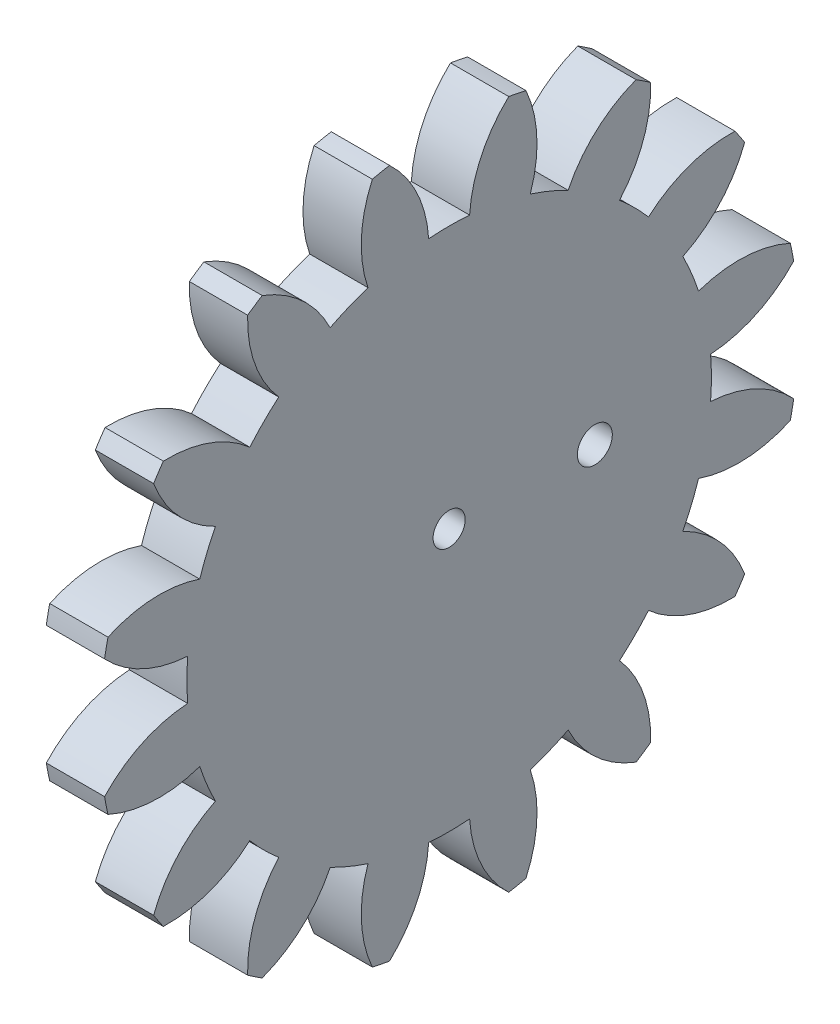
ISO-10303-21;
HEADER;
FILE_DESCRIPTION(('STEP AP214'),'2;1');
FILE_NAME('part.step','',(''),(''),'','','');
FILE_SCHEMA(('AUTOMOTIVE_DESIGN { 1 0 10303 214 1 1 1 1 }'));
ENDSEC;
DATA;
#1=APPLICATION_CONTEXT('core data for automotive mechanical design processes');
#2=APPLICATION_PROTOCOL_DEFINITION('international standard','automotive_design',2000,#1);
#3=PRODUCT_CONTEXT('',#1,'mechanical');
#4=PRODUCT('Part','Part','',(#3));
#5=PRODUCT_RELATED_PRODUCT_CATEGORY('part','',(#4));
#6=PRODUCT_DEFINITION_FORMATION('','',#4);
#7=PRODUCT_DEFINITION_CONTEXT('part definition',#1,'design');
#8=PRODUCT_DEFINITION('design','',#6,#7);
#9=PRODUCT_DEFINITION_SHAPE('','',#8);
#10=(LENGTH_UNIT() NAMED_UNIT(*) SI_UNIT(.MILLI.,.METRE.));
#11=(NAMED_UNIT(*) PLANE_ANGLE_UNIT() SI_UNIT($,.RADIAN.));
#12=(NAMED_UNIT(*) SI_UNIT($,.STERADIAN.) SOLID_ANGLE_UNIT());
#13=UNCERTAINTY_MEASURE_WITH_UNIT(LENGTH_MEASURE(1.E-05),#10,'distance_accuracy_value','');
#14=(GEOMETRIC_REPRESENTATION_CONTEXT(3) GLOBAL_UNCERTAINTY_ASSIGNED_CONTEXT((#13)) GLOBAL_UNIT_ASSIGNED_CONTEXT((#10,
#11,#12)) REPRESENTATION_CONTEXT('',''));
#15=CARTESIAN_POINT('',(0.,0.,0.));
#16=DIRECTION('',(0.,0.,1.));
#17=DIRECTION('',(1.,0.,0.));
#18=AXIS2_PLACEMENT_3D('',#15,#16,#17);
#19=CARTESIAN_POINT('',(6.35,0.,0.));
#20=DIRECTION('',(-1.,0.,0.));
#21=DIRECTION('',(0.,0.,1.));
#22=AXIS2_PLACEMENT_3D('',#19,#20,#21);
#23=PLANE('',#22);
#24=CARTESIAN_POINT('',(6.35,0.,-15.875));
#25=DIRECTION('',(1.,0.,0.));
#26=DIRECTION('',(0.,0.,-1.));
#27=AXIS2_PLACEMENT_3D('',#24,#25,#26);
#28=CIRCLE('',#27,1.905);
#29=CARTESIAN_POINT('',(6.35,0.,-17.78));
#30=VERTEX_POINT('',#29);
#31=EDGE_CURVE('E964',#30,#30,#28,.T.);
#32=ORIENTED_EDGE('',*,*,#31,.F.);
#33=EDGE_LOOP('',(#32));
#34=FACE_BOUND('',#33,.T.);
#35=CARTESIAN_POINT('',(6.35,19.5192337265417,-25.135290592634));
#36=DIRECTION('',(-1.,0.,0.));
#37=DIRECTION('',(0.,-0.382683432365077,-0.923879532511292));
#38=AXIS2_PLACEMENT_3D('',#35,#36,#37);
#39=CIRCLE('',#38,13.5466666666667);
#40=CARTESIAN_POINT('',(6.35,25.4641749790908,-12.9627866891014));
#41=VERTEX_POINT('',#40);
#42=CARTESIAN_POINT('',(6.35,32.1990920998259,-20.3673382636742));
#43=VERTEX_POINT('',#42);
#44=EDGE_CURVE('E445',#41,#43,#39,.T.);
#45=ORIENTED_EDGE('',*,*,#44,.F.);
#46=CARTESIAN_POINT('',(6.35,0.,0.));
#47=DIRECTION('',(-1.,0.,0.));
#48=DIRECTION('',(0.,-0.382683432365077,-0.923879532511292));
#49=AXIS2_PLACEMENT_3D('',#46,#47,#48);
#50=CIRCLE('',#49,28.57373);
#51=CARTESIAN_POINT('',(6.35,27.1719651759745,-8.83981643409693));
#52=VERTEX_POINT('',#51);
#53=EDGE_CURVE('E444',#52,#41,#50,.T.);
#54=ORIENTED_EDGE('',*,*,#53,.F.);
#55=CARTESIAN_POINT('',(6.35,31.5755169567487,3.97115189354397));
#56=DIRECTION('',(-1.,0.,0.));
#57=DIRECTION('',(0.,-0.382683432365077,-0.923879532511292));
#58=AXIS2_PLACEMENT_3D('',#55,#56,#57);
#59=CIRCLE('',#58,13.5466666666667);
#60=CARTESIAN_POINT('',(6.35,37.1700793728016,-8.36631337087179));
#61=VERTEX_POINT('',#60);
#62=EDGE_CURVE('E433',#61,#52,#59,.T.);
#63=ORIENTED_EDGE('',*,*,#62,.F.);
#64=CARTESIAN_POINT('',(6.35,0.,0.));
#65=DIRECTION('',(-1.,0.,0.));
#66=DIRECTION('',(0.,0.,1.));
#67=AXIS2_PLACEMENT_3D('',#64,#65,#66);
#68=CIRCLE('',#67,38.1);
#69=CARTESIAN_POINT('',(6.35,37.5423250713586,-6.49490786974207));
#70=VERTEX_POINT('',#69);
#71=EDGE_CURVE('E800',#70,#61,#68,.T.);
#72=ORIENTED_EDGE('',*,*,#71,.F.);
#73=CARTESIAN_POINT('',(6.35,27.6522798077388,-15.752293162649));
#74=DIRECTION('',(-1.,0.,0.));
#75=DIRECTION('',(0.,0.,-1.));
#76=AXIS2_PLACEMENT_3D('',#73,#74,#75);
#77=CIRCLE('',#76,13.5466666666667);
#78=CARTESIAN_POINT('',(6.35,28.4864737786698,-2.23133542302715));
#79=VERTEX_POINT('',#78);
#80=EDGE_CURVE('E773',#79,#70,#77,.T.);
#81=ORIENTED_EDGE('',*,*,#80,.F.);
#82=CARTESIAN_POINT('',(6.35,0.,0.));
#83=DIRECTION('',(-1.,0.,0.));
#84=DIRECTION('',(0.,0.,-1.));
#85=AXIS2_PLACEMENT_3D('',#82,#83,#84);
#86=CIRCLE('',#85,28.57373);
#87=CARTESIAN_POINT('',(6.35,28.4864737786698,2.23133542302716));
#88=VERTEX_POINT('',#87);
#89=EDGE_CURVE('E778',#88,#79,#86,.T.);
#90=ORIENTED_EDGE('',*,*,#89,.F.);
#91=CARTESIAN_POINT('',(6.35,27.6522798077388,15.752293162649));
#92=DIRECTION('',(-1.,0.,0.));
#93=DIRECTION('',(0.,0.,-1.));
#94=AXIS2_PLACEMENT_3D('',#91,#92,#93);
#95=CIRCLE('',#94,13.5466666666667);
#96=CARTESIAN_POINT('',(6.35,37.5423250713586,6.49490786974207));
#97=VERTEX_POINT('',#96);
#98=EDGE_CURVE('E775',#97,#88,#95,.T.);
#99=ORIENTED_EDGE('',*,*,#98,.F.);
#100=CARTESIAN_POINT('',(6.35,37.1700793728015,8.36631337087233));
#101=VERTEX_POINT('',#100);
#102=EDGE_CURVE('E798',#101,#97,#68,.T.);
#103=ORIENTED_EDGE('',*,*,#102,.F.);
#104=CARTESIAN_POINT('',(6.35,31.5755169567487,-3.97115189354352));
#105=DIRECTION('',(-1.,0.,0.));
#106=DIRECTION('',(0.,0.382683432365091,-0.923879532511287));
#107=AXIS2_PLACEMENT_3D('',#104,#105,#106);
#108=CIRCLE('',#107,13.5466666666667);
#109=CARTESIAN_POINT('',(6.35,27.1719651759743,8.83981643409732));
#110=VERTEX_POINT('',#109);
#111=EDGE_CURVE('E751',#110,#101,#108,.T.);
#112=ORIENTED_EDGE('',*,*,#111,.F.);
#113=CARTESIAN_POINT('',(6.35,0.,0.));
#114=DIRECTION('',(-1.,0.,0.));
#115=DIRECTION('',(0.,0.382683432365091,-0.923879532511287));
#116=AXIS2_PLACEMENT_3D('',#113,#114,#115);
#117=CIRCLE('',#116,28.57373);
#118=CARTESIAN_POINT('',(6.35,25.4641749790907,12.9627866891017));
#119=VERTEX_POINT('',#118);
#120=EDGE_CURVE('E756',#119,#110,#117,.T.);
#121=ORIENTED_EDGE('',*,*,#120,.F.);
#122=CARTESIAN_POINT('',(6.35,19.5192337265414,25.1352905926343));
#123=DIRECTION('',(-1.,0.,0.));
#124=DIRECTION('',(0.,0.382683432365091,-0.923879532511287));
#125=AXIS2_PLACEMENT_3D('',#122,#123,#124);
#126=CIRCLE('',#125,13.5466666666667);
#127=CARTESIAN_POINT('',(6.35,32.1990920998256,20.3673382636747));
#128=VERTEX_POINT('',#127);
#129=EDGE_CURVE('E753',#128,#119,#126,.T.);
#130=ORIENTED_EDGE('',*,*,#129,.F.);
#131=CARTESIAN_POINT('',(6.35,31.1390260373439,21.953839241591));
#132=VERTEX_POINT('',#131);
#133=EDGE_CURVE('E913',#132,#128,#68,.T.);
#134=ORIENTED_EDGE('',*,*,#133,.F.);
#135=CARTESIAN_POINT('',(6.35,30.6916678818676,8.41456125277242));
#136=DIRECTION('',(-1.,0.,0.));
#137=DIRECTION('',(0.,0.707106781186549,-0.707106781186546));
#138=AXIS2_PLACEMENT_3D('',#135,#136,#137);
#139=CIRCLE('',#138,13.5466666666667);
#140=CARTESIAN_POINT('',(6.35,21.7207711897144,18.565186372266));
#141=VERTEX_POINT('',#140);
#142=EDGE_CURVE('E729',#141,#132,#139,.T.);
#143=ORIENTED_EDGE('',*,*,#142,.F.);
#144=CARTESIAN_POINT('',(6.35,0.,0.));
#145=DIRECTION('',(-1.,0.,0.));
#146=DIRECTION('',(0.,0.707106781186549,-0.707106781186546));
#147=AXIS2_PLACEMENT_3D('',#144,#145,#146);
#148=CIRCLE('',#147,28.57373);
#149=CARTESIAN_POINT('',(6.35,18.5651863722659,21.7207711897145));
#150=VERTEX_POINT('',#149);
#151=EDGE_CURVE('E734',#150,#141,#148,.T.);
#152=ORIENTED_EDGE('',*,*,#151,.F.);
#153=CARTESIAN_POINT('',(6.35,8.41456125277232,30.6916678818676));
#154=DIRECTION('',(-1.,0.,0.));
#155=DIRECTION('',(0.,0.707106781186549,-0.707106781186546));
#156=AXIS2_PLACEMENT_3D('',#153,#154,#155);
#157=CIRCLE('',#156,13.5466666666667);
#158=CARTESIAN_POINT('',(6.35,21.9538392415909,31.139026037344));
#159=VERTEX_POINT('',#158);
#160=EDGE_CURVE('E731',#159,#150,#157,.T.);
#161=ORIENTED_EDGE('',*,*,#160,.F.);
#162=CARTESIAN_POINT('',(6.35,20.3673382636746,32.1990920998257));
#163=VERTEX_POINT('',#162);
#164=EDGE_CURVE('E908',#163,#159,#68,.T.);
#165=ORIENTED_EDGE('',*,*,#164,.F.);
#166=CARTESIAN_POINT('',(6.35,25.1352905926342,19.5192337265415));
#167=DIRECTION('',(-1.,0.,0.));
#168=DIRECTION('',(0.,0.923879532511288,-0.382683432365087));
#169=AXIS2_PLACEMENT_3D('',#166,#167,#168);
#170=CIRCLE('',#169,13.5466666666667);
#171=CARTESIAN_POINT('',(6.35,12.9627866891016,25.4641749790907));
#172=VERTEX_POINT('',#171);
#173=EDGE_CURVE('E707',#172,#163,#170,.T.);
#174=ORIENTED_EDGE('',*,*,#173,.F.);
#175=CARTESIAN_POINT('',(6.35,0.,0.));
#176=DIRECTION('',(-1.,0.,0.));
#177=DIRECTION('',(0.,0.923879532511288,-0.382683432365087));
#178=AXIS2_PLACEMENT_3D('',#175,#176,#177);
#179=CIRCLE('',#178,28.57373);
#180=CARTESIAN_POINT('',(6.35,8.83981643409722,27.1719651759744));
#181=VERTEX_POINT('',#180);
#182=EDGE_CURVE('E712',#181,#172,#179,.T.);
#183=ORIENTED_EDGE('',*,*,#182,.F.);
#184=CARTESIAN_POINT('',(6.35,-3.97115189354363,31.5755169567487));
#185=DIRECTION('',(-1.,0.,0.));
#186=DIRECTION('',(0.,0.923879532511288,-0.382683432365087));
#187=AXIS2_PLACEMENT_3D('',#184,#185,#186);
#188=CIRCLE('',#187,13.5466666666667);
#189=CARTESIAN_POINT('',(6.35,8.3663133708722,37.1700793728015));
#190=VERTEX_POINT('',#189);
#191=EDGE_CURVE('E709',#190,#181,#188,.T.);
#192=ORIENTED_EDGE('',*,*,#191,.F.);
#193=CARTESIAN_POINT('',(6.35,6.49490786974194,37.5423250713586));
#194=VERTEX_POINT('',#193);
#195=EDGE_CURVE('E903',#194,#190,#68,.T.);
#196=ORIENTED_EDGE('',*,*,#195,.F.);
#197=CARTESIAN_POINT('',(6.35,15.7522931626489,27.6522798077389));
#198=DIRECTION('',(-1.,0.,0.));
#199=DIRECTION('',(0.,1.,0.));
#200=AXIS2_PLACEMENT_3D('',#197,#198,#199);
#201=CIRCLE('',#200,13.5466666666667);
#202=CARTESIAN_POINT('',(6.35,2.23133542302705,28.4864737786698));
#203=VERTEX_POINT('',#202);
#204=EDGE_CURVE('E685',#203,#194,#201,.T.);
#205=ORIENTED_EDGE('',*,*,#204,.F.);
#206=CARTESIAN_POINT('',(6.35,0.,0.));
#207=DIRECTION('',(-1.,0.,0.));
#208=DIRECTION('',(0.,1.,0.));
#209=AXIS2_PLACEMENT_3D('',#206,#207,#208);
#210=CIRCLE('',#209,28.57373);
#211=CARTESIAN_POINT('',(6.35,-2.23133542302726,28.4864737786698));
#212=VERTEX_POINT('',#211);
#213=EDGE_CURVE('E690',#212,#203,#210,.T.);
#214=ORIENTED_EDGE('',*,*,#213,.F.);
#215=CARTESIAN_POINT('',(6.35,-15.7522931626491,27.6522798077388));
#216=DIRECTION('',(-1.,0.,0.));
#217=DIRECTION('',(0.,1.,0.));
#218=AXIS2_PLACEMENT_3D('',#215,#216,#217);
#219=CIRCLE('',#218,13.5466666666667);
#220=CARTESIAN_POINT('',(6.35,-6.49490786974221,37.5423250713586));
#221=VERTEX_POINT('',#220);
#222=EDGE_CURVE('E687',#221,#212,#219,.T.);
#223=ORIENTED_EDGE('',*,*,#222,.F.);
#224=CARTESIAN_POINT('',(6.35,-8.36631337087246,37.1700793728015));
#225=VERTEX_POINT('',#224);
#226=EDGE_CURVE('E898',#225,#221,#68,.T.);
#227=ORIENTED_EDGE('',*,*,#226,.F.);
#228=CARTESIAN_POINT('',(6.35,3.9711518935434,31.5755169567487));
#229=DIRECTION('',(-1.,0.,0.));
#230=DIRECTION('',(0.,0.923879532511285,0.382683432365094));
#231=AXIS2_PLACEMENT_3D('',#228,#229,#230);
#232=CIRCLE('',#231,13.5466666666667);
#233=CARTESIAN_POINT('',(6.35,-8.83981643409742,27.1719651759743));
#234=VERTEX_POINT('',#233);
#235=EDGE_CURVE('E663',#234,#225,#232,.T.);
#236=ORIENTED_EDGE('',*,*,#235,.F.);
#237=CARTESIAN_POINT('',(6.35,0.,0.));
#238=DIRECTION('',(-1.,0.,0.));
#239=DIRECTION('',(0.,0.923879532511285,0.382683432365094));
#240=AXIS2_PLACEMENT_3D('',#237,#238,#239);
#241=CIRCLE('',#240,28.57373);
#242=CARTESIAN_POINT('',(6.35,-12.9627866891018,25.4641749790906));
#243=VERTEX_POINT('',#242);
#244=EDGE_CURVE('E668',#243,#234,#241,.T.);
#245=ORIENTED_EDGE('',*,*,#244,.F.);
#246=CARTESIAN_POINT('',(6.35,-25.1352905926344,19.5192337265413));
#247=DIRECTION('',(-1.,0.,0.));
#248=DIRECTION('',(0.,0.923879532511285,0.382683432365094));
#249=AXIS2_PLACEMENT_3D('',#246,#247,#248);
#250=CIRCLE('',#249,13.5466666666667);
#251=CARTESIAN_POINT('',(6.35,-20.3673382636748,32.1990920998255));
#252=VERTEX_POINT('',#251);
#253=EDGE_CURVE('E665',#252,#243,#250,.T.);
#254=ORIENTED_EDGE('',*,*,#253,.F.);
#255=CARTESIAN_POINT('',(6.35,-21.9538392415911,31.1390260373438));
#256=VERTEX_POINT('',#255);
#257=EDGE_CURVE('E893',#256,#252,#68,.T.);
#258=ORIENTED_EDGE('',*,*,#257,.F.);
#259=CARTESIAN_POINT('',(6.35,-8.41456125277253,30.6916678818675));
#260=DIRECTION('',(-1.,0.,0.));
#261=DIRECTION('',(0.,0.707106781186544,0.707106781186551));
#262=AXIS2_PLACEMENT_3D('',#259,#260,#261);
#263=CIRCLE('',#262,13.5466666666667);
#264=CARTESIAN_POINT('',(6.35,-18.5651863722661,21.7207711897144));
#265=VERTEX_POINT('',#264);
#266=EDGE_CURVE('E641',#265,#256,#263,.T.);
#267=ORIENTED_EDGE('',*,*,#266,.F.);
#268=CARTESIAN_POINT('',(6.35,0.,0.));
#269=DIRECTION('',(-1.,0.,0.));
#270=DIRECTION('',(0.,0.707106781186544,0.707106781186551));
#271=AXIS2_PLACEMENT_3D('',#268,#269,#270);
#272=CIRCLE('',#271,28.57373);
#273=CARTESIAN_POINT('',(6.35,-21.7207711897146,18.5651863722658));
#274=VERTEX_POINT('',#273);
#275=EDGE_CURVE('E646',#274,#265,#272,.T.);
#276=ORIENTED_EDGE('',*,*,#275,.F.);
#277=CARTESIAN_POINT('',(6.35,-30.6916678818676,8.41456125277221));
#278=DIRECTION('',(-1.,0.,0.));
#279=DIRECTION('',(0.,0.707106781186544,0.707106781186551));
#280=AXIS2_PLACEMENT_3D('',#277,#278,#279);
#281=CIRCLE('',#280,13.5466666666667);
#282=CARTESIAN_POINT('',(6.35,-31.139026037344,21.9538392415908));
#283=VERTEX_POINT('',#282);
#284=EDGE_CURVE('E643',#283,#274,#281,.T.);
#285=ORIENTED_EDGE('',*,*,#284,.F.);
#286=CARTESIAN_POINT('',(6.35,-32.1990920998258,20.3673382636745));
#287=VERTEX_POINT('',#286);
#288=EDGE_CURVE('E888',#287,#283,#68,.T.);
#289=ORIENTED_EDGE('',*,*,#288,.F.);
#290=CARTESIAN_POINT('',(6.35,-19.5192337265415,25.1352905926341));
#291=DIRECTION('',(-1.,0.,0.));
#292=DIRECTION('',(0.,0.382683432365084,0.923879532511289));
#293=AXIS2_PLACEMENT_3D('',#290,#291,#292);
#294=CIRCLE('',#293,13.5466666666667);
#295=CARTESIAN_POINT('',(6.35,-25.4641749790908,12.9627866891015));
#296=VERTEX_POINT('',#295);
#297=EDGE_CURVE('E619',#296,#287,#294,.T.);
#298=ORIENTED_EDGE('',*,*,#297,.F.);
#299=CARTESIAN_POINT('',(6.35,0.,0.));
#300=DIRECTION('',(-1.,0.,0.));
#301=DIRECTION('',(0.,0.382683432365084,0.923879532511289));
#302=AXIS2_PLACEMENT_3D('',#299,#300,#301);
#303=CIRCLE('',#302,28.57373);
#304=CARTESIAN_POINT('',(6.35,-27.1719651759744,8.83981643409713));
#305=VERTEX_POINT('',#304);
#306=EDGE_CURVE('E624',#305,#296,#303,.T.);
#307=ORIENTED_EDGE('',*,*,#306,.F.);
#308=CARTESIAN_POINT('',(6.35,-31.5755169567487,-3.97115189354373));
#309=DIRECTION('',(-1.,0.,0.));
#310=DIRECTION('',(0.,0.382683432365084,0.923879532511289));
#311=AXIS2_PLACEMENT_3D('',#308,#309,#310);
#312=CIRCLE('',#311,13.5466666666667);
#313=CARTESIAN_POINT('',(6.35,-37.1700793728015,8.36631337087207));
#314=VERTEX_POINT('',#313);
#315=EDGE_CURVE('E621',#314,#305,#312,.T.);
#316=ORIENTED_EDGE('',*,*,#315,.F.);
#317=CARTESIAN_POINT('',(6.35,-37.5423250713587,6.49490786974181));
#318=VERTEX_POINT('',#317);
#319=EDGE_CURVE('E883',#318,#314,#68,.T.);
#320=ORIENTED_EDGE('',*,*,#319,.F.);
#321=CARTESIAN_POINT('',(6.35,-27.6522798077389,15.7522931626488));
#322=DIRECTION('',(-1.,0.,0.));
#323=DIRECTION('',(0.,0.,1.));
#324=AXIS2_PLACEMENT_3D('',#321,#322,#323);
#325=CIRCLE('',#324,13.5466666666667);
#326=CARTESIAN_POINT('',(6.35,-28.4864737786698,2.23133542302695));
#327=VERTEX_POINT('',#326);
#328=EDGE_CURVE('E597',#327,#318,#325,.T.);
#329=ORIENTED_EDGE('',*,*,#328,.F.);
#330=CARTESIAN_POINT('',(6.35,0.,0.));
#331=DIRECTION('',(-1.,0.,0.));
#332=DIRECTION('',(0.,0.,1.));
#333=AXIS2_PLACEMENT_3D('',#330,#331,#332);
#334=CIRCLE('',#333,28.57373);
#335=CARTESIAN_POINT('',(6.35,-28.4864737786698,-2.23133542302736));
#336=VERTEX_POINT('',#335);
#337=EDGE_CURVE('E602',#336,#327,#334,.T.);
#338=ORIENTED_EDGE('',*,*,#337,.F.);
#339=CARTESIAN_POINT('',(6.35,-27.6522798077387,-15.7522931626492));
#340=DIRECTION('',(-1.,0.,0.));
#341=DIRECTION('',(0.,0.,1.));
#342=AXIS2_PLACEMENT_3D('',#339,#340,#341);
#343=CIRCLE('',#342,13.5466666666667);
#344=CARTESIAN_POINT('',(6.35,-37.5423250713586,-6.49490786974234));
#345=VERTEX_POINT('',#344);
#346=EDGE_CURVE('E599',#345,#336,#343,.T.);
#347=ORIENTED_EDGE('',*,*,#346,.F.);
#348=CARTESIAN_POINT('',(6.35,-37.1700793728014,-8.36631337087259));
#349=VERTEX_POINT('',#348);
#350=EDGE_CURVE('E878',#349,#345,#68,.T.);
#351=ORIENTED_EDGE('',*,*,#350,.F.);
#352=CARTESIAN_POINT('',(6.35,-31.5755169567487,3.97115189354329));
#353=DIRECTION('',(-1.,0.,0.));
#354=DIRECTION('',(0.,-0.382683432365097,0.923879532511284));
#355=AXIS2_PLACEMENT_3D('',#352,#353,#354);
#356=CIRCLE('',#355,13.5466666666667);
#357=CARTESIAN_POINT('',(6.35,-27.1719651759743,-8.83981643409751));
#358=VERTEX_POINT('',#357);
#359=EDGE_CURVE('E575',#358,#349,#356,.T.);
#360=ORIENTED_EDGE('',*,*,#359,.F.);
#361=CARTESIAN_POINT('',(6.35,0.,0.));
#362=DIRECTION('',(-1.,0.,0.));
#363=DIRECTION('',(0.,-0.382683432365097,0.923879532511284));
#364=AXIS2_PLACEMENT_3D('',#361,#362,#363);
#365=CIRCLE('',#364,28.57373);
#366=CARTESIAN_POINT('',(6.35,-25.4641749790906,-12.9627866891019));
#367=VERTEX_POINT('',#366);
#368=EDGE_CURVE('E580',#367,#358,#365,.T.);
#369=ORIENTED_EDGE('',*,*,#368,.F.);
#370=CARTESIAN_POINT('',(6.35,-19.5192337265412,-25.1352905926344));
#371=DIRECTION('',(-1.,0.,0.));
#372=DIRECTION('',(0.,-0.382683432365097,0.923879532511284));
#373=AXIS2_PLACEMENT_3D('',#370,#371,#372);
#374=CIRCLE('',#373,13.5466666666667);
#375=CARTESIAN_POINT('',(6.35,-32.1990920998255,-20.3673382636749));
#376=VERTEX_POINT('',#375);
#377=EDGE_CURVE('E577',#376,#367,#374,.T.);
#378=ORIENTED_EDGE('',*,*,#377,.F.);
#379=CARTESIAN_POINT('',(6.35,-31.1390260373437,-21.9538392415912));
#380=VERTEX_POINT('',#379);
#381=EDGE_CURVE('E873',#380,#376,#68,.T.);
#382=ORIENTED_EDGE('',*,*,#381,.F.);
#383=CARTESIAN_POINT('',(6.35,-30.6916678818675,-8.41456125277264));
#384=DIRECTION('',(-1.,0.,0.));
#385=DIRECTION('',(0.,-0.707106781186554,0.707106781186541));
#386=AXIS2_PLACEMENT_3D('',#383,#384,#385);
#387=CIRCLE('',#386,13.5466666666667);
#388=CARTESIAN_POINT('',(6.35,-21.7207711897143,-18.5651863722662));
#389=VERTEX_POINT('',#388);
#390=EDGE_CURVE('E553',#389,#380,#387,.T.);
#391=ORIENTED_EDGE('',*,*,#390,.F.);
#392=CARTESIAN_POINT('',(6.35,0.,0.));
#393=DIRECTION('',(-1.,0.,0.));
#394=DIRECTION('',(0.,-0.707106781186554,0.707106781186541));
#395=AXIS2_PLACEMENT_3D('',#392,#393,#394);
#396=CIRCLE('',#395,28.57373);
#397=CARTESIAN_POINT('',(6.35,-18.5651863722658,-21.7207711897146));
#398=VERTEX_POINT('',#397);
#399=EDGE_CURVE('E558',#398,#389,#396,.T.);
#400=ORIENTED_EDGE('',*,*,#399,.F.);
#401=CARTESIAN_POINT('',(6.35,-8.4145612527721,-30.6916678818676));
#402=DIRECTION('',(-1.,0.,0.));
#403=DIRECTION('',(0.,-0.707106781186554,0.707106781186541));
#404=AXIS2_PLACEMENT_3D('',#401,#402,#403);
#405=CIRCLE('',#404,13.5466666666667);
#406=CARTESIAN_POINT('',(6.35,-21.9538392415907,-31.1390260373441));
#407=VERTEX_POINT('',#406);
#408=EDGE_CURVE('E555',#407,#398,#405,.T.);
#409=ORIENTED_EDGE('',*,*,#408,.F.);
#410=CARTESIAN_POINT('',(6.35,-20.3673382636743,-32.1990920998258));
#411=VERTEX_POINT('',#410);
#412=EDGE_CURVE('E868',#411,#407,#68,.T.);
#413=ORIENTED_EDGE('',*,*,#412,.F.);
#414=CARTESIAN_POINT('',(6.35,-25.1352905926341,-19.5192337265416));
#415=DIRECTION('',(-1.,0.,0.));
#416=DIRECTION('',(0.,-0.923879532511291,0.382683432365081));
#417=AXIS2_PLACEMENT_3D('',#414,#415,#416);
#418=CIRCLE('',#417,13.5466666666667);
#419=CARTESIAN_POINT('',(6.35,-12.9627866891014,-25.4641749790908));
#420=VERTEX_POINT('',#419);
#421=EDGE_CURVE('E531',#420,#411,#418,.T.);
#422=ORIENTED_EDGE('',*,*,#421,.F.);
#423=CARTESIAN_POINT('',(6.35,0.,0.));
#424=DIRECTION('',(-1.,0.,0.));
#425=DIRECTION('',(0.,-0.923879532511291,0.382683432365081));
#426=AXIS2_PLACEMENT_3D('',#423,#424,#425);
#427=CIRCLE('',#426,28.57373);
#428=CARTESIAN_POINT('',(6.35,-8.83981643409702,-27.1719651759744));
#429=VERTEX_POINT('',#428);
#430=EDGE_CURVE('E536',#429,#420,#427,.T.);
#431=ORIENTED_EDGE('',*,*,#430,.F.);
#432=CARTESIAN_POINT('',(6.35,3.97115189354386,-31.5755169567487));
#433=DIRECTION('',(-1.,0.,0.));
#434=DIRECTION('',(0.,-0.923879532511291,0.382683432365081));
#435=AXIS2_PLACEMENT_3D('',#432,#433,#434);
#436=CIRCLE('',#435,13.5466666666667);
#437=CARTESIAN_POINT('',(6.35,-8.36631337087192,-37.1700793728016));
#438=VERTEX_POINT('',#437);
#439=EDGE_CURVE('E533',#438,#429,#436,.T.);
#440=ORIENTED_EDGE('',*,*,#439,.F.);
#441=CARTESIAN_POINT('',(6.35,-6.49490786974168,-37.5423250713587));
#442=VERTEX_POINT('',#441);
#443=EDGE_CURVE('E863',#442,#438,#68,.T.);
#444=ORIENTED_EDGE('',*,*,#443,.F.);
#445=CARTESIAN_POINT('',(6.35,-15.7522931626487,-27.652279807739));
#446=DIRECTION('',(-1.,0.,0.));
#447=DIRECTION('',(0.,-1.,0.));
#448=AXIS2_PLACEMENT_3D('',#445,#446,#447);
#449=CIRCLE('',#448,13.5466666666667);
#450=CARTESIAN_POINT('',(6.35,-2.23133542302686,-28.4864737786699));
#451=VERTEX_POINT('',#450);
#452=EDGE_CURVE('E509',#451,#442,#449,.T.);
#453=ORIENTED_EDGE('',*,*,#452,.F.);
#454=CARTESIAN_POINT('',(6.35,0.,0.));
#455=DIRECTION('',(-1.,0.,0.));
#456=DIRECTION('',(0.,-1.,0.));
#457=AXIS2_PLACEMENT_3D('',#454,#455,#456);
#458=CIRCLE('',#457,28.57373);
#459=CARTESIAN_POINT('',(6.35,2.23133542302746,-28.4864737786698));
#460=VERTEX_POINT('',#459);
#461=EDGE_CURVE('E514',#460,#451,#458,.T.);
#462=ORIENTED_EDGE('',*,*,#461,.F.);
#463=CARTESIAN_POINT('',(6.35,15.7522931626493,-27.6522798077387));
#464=DIRECTION('',(-1.,0.,0.));
#465=DIRECTION('',(0.,-1.,0.));
#466=AXIS2_PLACEMENT_3D('',#463,#464,#465);
#467=CIRCLE('',#466,13.5466666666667);
#468=CARTESIAN_POINT('',(6.35,6.49490786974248,-37.5423250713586));
#469=VERTEX_POINT('',#468);
#470=EDGE_CURVE('E511',#469,#460,#467,.T.);
#471=ORIENTED_EDGE('',*,*,#470,.F.);
#472=CARTESIAN_POINT('',(6.35,8.3663133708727,-37.1700793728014));
#473=VERTEX_POINT('',#472);
#474=EDGE_CURVE('E858',#473,#469,#68,.T.);
#475=ORIENTED_EDGE('',*,*,#474,.F.);
#476=CARTESIAN_POINT('',(6.35,-3.9711518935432,-31.5755169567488));
#477=DIRECTION('',(-1.,0.,0.));
#478=DIRECTION('',(0.,-0.923879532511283,-0.3826834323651));
#479=AXIS2_PLACEMENT_3D('',#476,#477,#478);
#480=CIRCLE('',#479,13.5466666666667);
#481=CARTESIAN_POINT('',(6.35,8.83981643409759,-27.1719651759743));
#482=VERTEX_POINT('',#481);
#483=EDGE_CURVE('E487',#482,#473,#480,.T.);
#484=ORIENTED_EDGE('',*,*,#483,.F.);
#485=CARTESIAN_POINT('',(6.35,0.,0.));
#486=DIRECTION('',(-1.,0.,0.));
#487=DIRECTION('',(0.,-0.923879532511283,-0.3826834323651));
#488=AXIS2_PLACEMENT_3D('',#485,#486,#487);
#489=CIRCLE('',#488,28.57373);
#490=CARTESIAN_POINT('',(6.35,12.962786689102,-25.4641749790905));
#491=VERTEX_POINT('',#490);
#492=EDGE_CURVE('E492',#491,#482,#489,.T.);
#493=ORIENTED_EDGE('',*,*,#492,.F.);
#494=CARTESIAN_POINT('',(6.35,25.1352905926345,-19.5192337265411));
#495=DIRECTION('',(-1.,0.,0.));
#496=DIRECTION('',(0.,-0.923879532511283,-0.3826834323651));
#497=AXIS2_PLACEMENT_3D('',#494,#495,#496);
#498=CIRCLE('',#497,13.5466666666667);
#499=CARTESIAN_POINT('',(6.35,20.367338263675,-32.1990920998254));
#500=VERTEX_POINT('',#499);
#501=EDGE_CURVE('E489',#500,#491,#498,.T.);
#502=ORIENTED_EDGE('',*,*,#501,.F.);
#503=CARTESIAN_POINT('',(6.35,21.9538392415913,-31.1390260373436));
#504=VERTEX_POINT('',#503);
#505=EDGE_CURVE('E857',#504,#500,#68,.T.);
#506=ORIENTED_EDGE('',*,*,#505,.F.);
#507=CARTESIAN_POINT('',(6.35,8.41456125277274,-30.6916678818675));
#508=DIRECTION('',(-1.,0.,0.));
#509=DIRECTION('',(0.,-0.707106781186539,-0.707106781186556));
#510=AXIS2_PLACEMENT_3D('',#507,#508,#509);
#511=CIRCLE('',#510,13.5466666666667);
#512=CARTESIAN_POINT('',(6.35,18.5651863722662,-21.7207711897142));
#513=VERTEX_POINT('',#512);
#514=EDGE_CURVE('E467',#513,#504,#511,.T.);
#515=ORIENTED_EDGE('',*,*,#514,.F.);
#516=CARTESIAN_POINT('',(6.35,0.,0.));
#517=DIRECTION('',(-1.,0.,0.));
#518=DIRECTION('',(0.,-0.707106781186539,-0.707106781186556));
#519=AXIS2_PLACEMENT_3D('',#516,#517,#518);
#520=CIRCLE('',#519,28.57373);
#521=CARTESIAN_POINT('',(6.35,21.7207711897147,-18.5651863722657));
#522=VERTEX_POINT('',#521);
#523=EDGE_CURVE('E472',#522,#513,#520,.T.);
#524=ORIENTED_EDGE('',*,*,#523,.F.);
#525=CARTESIAN_POINT('',(6.35,30.6916678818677,-8.41456125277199));
#526=DIRECTION('',(-1.,0.,0.));
#527=DIRECTION('',(0.,-0.707106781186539,-0.707106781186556));
#528=AXIS2_PLACEMENT_3D('',#525,#526,#527);
#529=CIRCLE('',#528,13.5466666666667);
#530=CARTESIAN_POINT('',(6.35,31.1390260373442,-21.9538392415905));
#531=VERTEX_POINT('',#530);
#532=EDGE_CURVE('E469',#531,#522,#529,.T.);
#533=ORIENTED_EDGE('',*,*,#532,.F.);
#534=EDGE_CURVE('E803',#43,#531,#68,.T.);
#535=ORIENTED_EDGE('',*,*,#534,.F.);
#536=EDGE_LOOP('',(#45,#54,#63,#72,#81,#90,#99,#103,#112,#121,#130,#134,#143,#152,#161,#165,
#174,#183,#192,#196,#205,#214,#223,#227,#236,#245,#254,#258,#267,#276,#285,#289,#298,#307,#316,
#320,#329,#338,#347,#351,#360,#369,#378,#382,#391,#400,#409,#413,#422,#431,#440,#444,#453,#462,
#471,#475,#484,#493,#502,#506,#515,#524,#533,#535));
#537=FACE_BOUND('',#536,.T.);
#538=CARTESIAN_POINT('',(6.35,0.,0.));
#539=DIRECTION('',(1.,0.,0.));
#540=DIRECTION('',(0.,0.,-1.));
#541=AXIS2_PLACEMENT_3D('',#538,#539,#540);
#542=CIRCLE('',#541,1.75);
#543=CARTESIAN_POINT('',(6.35,0.,-1.75));
#544=VERTEX_POINT('',#543);
#545=EDGE_CURVE('E969',#544,#544,#542,.T.);
#546=ORIENTED_EDGE('',*,*,#545,.F.);
#547=EDGE_LOOP('',(#546));
#548=FACE_BOUND('',#547,.T.);
#549=ADVANCED_FACE('F33',(#34,#537,#548),#23,.F.);
#550=CARTESIAN_POINT('',(0.,0.,0.));
#551=DIRECTION('',(1.,0.,0.));
#552=DIRECTION('',(0.,0.,-1.));
#553=AXIS2_PLACEMENT_3D('',#550,#551,#552);
#554=PLANE('',#553);
#555=CARTESIAN_POINT('',(0.,0.,-15.875));
#556=DIRECTION('',(1.,0.,0.));
#557=DIRECTION('',(0.,0.,-1.));
#558=AXIS2_PLACEMENT_3D('',#555,#556,#557);
#559=CIRCLE('',#558,1.905);
#560=CARTESIAN_POINT('',(0.,0.,-17.78));
#561=VERTEX_POINT('',#560);
#562=EDGE_CURVE('E966',#561,#561,#559,.F.);
#563=ORIENTED_EDGE('',*,*,#562,.F.);
#564=EDGE_LOOP('',(#563));
#565=FACE_BOUND('',#564,.T.);
#566=CARTESIAN_POINT('',(0.,19.5192337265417,-25.135290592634));
#567=DIRECTION('',(-1.,0.,0.));
#568=DIRECTION('',(0.,-0.382683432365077,-0.923879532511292));
#569=AXIS2_PLACEMENT_3D('',#566,#567,#568);
#570=CIRCLE('',#569,13.5466666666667);
#571=CARTESIAN_POINT('',(0.,25.4641749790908,-12.9627866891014));
#572=VERTEX_POINT('',#571);
#573=CARTESIAN_POINT('',(0.,32.1990920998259,-20.3673382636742));
#574=VERTEX_POINT('',#573);
#575=EDGE_CURVE('E47',#572,#574,#570,.T.);
#576=ORIENTED_EDGE('',*,*,#575,.T.);
#577=CARTESIAN_POINT('',(0.,0.,0.));
#578=DIRECTION('',(-1.,0.,0.));
#579=DIRECTION('',(0.,0.,1.));
#580=AXIS2_PLACEMENT_3D('',#577,#578,#579);
#581=CIRCLE('',#580,38.1);
#582=CARTESIAN_POINT('',(0.,31.1390260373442,-21.9538392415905));
#583=VERTEX_POINT('',#582);
#584=EDGE_CURVE('E799',#574,#583,#581,.T.);
#585=ORIENTED_EDGE('',*,*,#584,.T.);
#586=CARTESIAN_POINT('',(0.,30.6916678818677,-8.41456125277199));
#587=DIRECTION('',(1.,0.,0.));
#588=DIRECTION('',(0.,0.,-1.));
#589=AXIS2_PLACEMENT_3D('',#586,#587,#588);
#590=CIRCLE('',#589,13.5466666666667);
#591=CARTESIAN_POINT('',(0.,21.7207711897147,-18.5651863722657));
#592=VERTEX_POINT('',#591);
#593=EDGE_CURVE('E40',#592,#583,#590,.T.);
#594=ORIENTED_EDGE('',*,*,#593,.F.);
#595=CARTESIAN_POINT('',(0.,0.,0.));
#596=DIRECTION('',(-1.,0.,0.));
#597=DIRECTION('',(0.,-0.707106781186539,-0.707106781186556));
#598=AXIS2_PLACEMENT_3D('',#595,#596,#597);
#599=CIRCLE('',#598,28.57373);
#600=CARTESIAN_POINT('',(0.,18.5651863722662,-21.7207711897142));
#601=VERTEX_POINT('',#600);
#602=EDGE_CURVE('E470',#592,#601,#599,.T.);
#603=ORIENTED_EDGE('',*,*,#602,.T.);
#604=CARTESIAN_POINT('',(0.,8.41456125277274,-30.6916678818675));
#605=DIRECTION('',(-1.,0.,0.));
#606=DIRECTION('',(0.,-0.707106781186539,-0.707106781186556));
#607=AXIS2_PLACEMENT_3D('',#604,#605,#606);
#608=CIRCLE('',#607,13.5466666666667);
#609=CARTESIAN_POINT('',(0.,21.9538392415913,-31.1390260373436));
#610=VERTEX_POINT('',#609);
#611=EDGE_CURVE('E55',#601,#610,#608,.T.);
#612=ORIENTED_EDGE('',*,*,#611,.T.);
#613=CARTESIAN_POINT('',(0.,20.367338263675,-32.1990920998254));
#614=VERTEX_POINT('',#613);
#615=EDGE_CURVE('E976',#610,#614,#581,.T.);
#616=ORIENTED_EDGE('',*,*,#615,.T.);
#617=CARTESIAN_POINT('',(0.,25.1352905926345,-19.5192337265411));
#618=DIRECTION('',(1.,0.,0.));
#619=DIRECTION('',(0.,0.,-1.));
#620=AXIS2_PLACEMENT_3D('',#617,#618,#619);
#621=CIRCLE('',#620,13.5466666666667);
#622=CARTESIAN_POINT('',(0.,12.962786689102,-25.4641749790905));
#623=VERTEX_POINT('',#622);
#624=EDGE_CURVE('E842',#623,#614,#621,.T.);
#625=ORIENTED_EDGE('',*,*,#624,.F.);
#626=CARTESIAN_POINT('',(0.,0.,0.));
#627=DIRECTION('',(-1.,0.,0.));
#628=DIRECTION('',(0.,-0.923879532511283,-0.3826834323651));
#629=AXIS2_PLACEMENT_3D('',#626,#627,#628);
#630=CIRCLE('',#629,28.57373);
#631=CARTESIAN_POINT('',(0.,8.83981643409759,-27.1719651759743));
#632=VERTEX_POINT('',#631);
#633=EDGE_CURVE('E490',#623,#632,#630,.T.);
#634=ORIENTED_EDGE('',*,*,#633,.T.);
#635=CARTESIAN_POINT('',(0.,-3.9711518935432,-31.5755169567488));
#636=DIRECTION('',(-1.,0.,0.));
#637=DIRECTION('',(0.,-0.923879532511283,-0.3826834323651));
#638=AXIS2_PLACEMENT_3D('',#635,#636,#637);
#639=CIRCLE('',#638,13.5466666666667);
#640=CARTESIAN_POINT('',(0.,8.3663133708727,-37.1700793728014));
#641=VERTEX_POINT('',#640);
#642=EDGE_CURVE('E486',#632,#641,#639,.T.);
#643=ORIENTED_EDGE('',*,*,#642,.T.);
#644=CARTESIAN_POINT('',(0.,6.49490786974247,-37.5423250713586));
#645=VERTEX_POINT('',#644);
#646=EDGE_CURVE('E977',#641,#645,#581,.T.);
#647=ORIENTED_EDGE('',*,*,#646,.T.);
#648=CARTESIAN_POINT('',(0.,15.7522931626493,-27.6522798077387));
#649=DIRECTION('',(1.,0.,0.));
#650=DIRECTION('',(0.,0.,-1.));
#651=AXIS2_PLACEMENT_3D('',#648,#649,#650);
#652=CIRCLE('',#651,13.5466666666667);
#653=CARTESIAN_POINT('',(0.,2.23133542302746,-28.4864737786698));
#654=VERTEX_POINT('',#653);
#655=EDGE_CURVE('E839',#654,#645,#652,.T.);
#656=ORIENTED_EDGE('',*,*,#655,.F.);
#657=CARTESIAN_POINT('',(0.,0.,0.));
#658=DIRECTION('',(-1.,0.,0.));
#659=DIRECTION('',(0.,-1.,0.));
#660=AXIS2_PLACEMENT_3D('',#657,#658,#659);
#661=CIRCLE('',#660,28.57373);
#662=CARTESIAN_POINT('',(0.,-2.23133542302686,-28.4864737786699));
#663=VERTEX_POINT('',#662);
#664=EDGE_CURVE('E512',#654,#663,#661,.T.);
#665=ORIENTED_EDGE('',*,*,#664,.T.);
#666=CARTESIAN_POINT('',(0.,-15.7522931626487,-27.652279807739));
#667=DIRECTION('',(-1.,0.,0.));
#668=DIRECTION('',(0.,-1.,0.));
#669=AXIS2_PLACEMENT_3D('',#666,#667,#668);
#670=CIRCLE('',#669,13.5466666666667);
#671=CARTESIAN_POINT('',(0.,-6.49490786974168,-37.5423250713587));
#672=VERTEX_POINT('',#671);
#673=EDGE_CURVE('E508',#663,#672,#670,.T.);
#674=ORIENTED_EDGE('',*,*,#673,.T.);
#675=CARTESIAN_POINT('',(0.,-8.36631337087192,-37.1700793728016));
#676=VERTEX_POINT('',#675);
#677=EDGE_CURVE('E980',#672,#676,#581,.T.);
#678=ORIENTED_EDGE('',*,*,#677,.T.);
#679=CARTESIAN_POINT('',(0.,3.97115189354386,-31.5755169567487));
#680=DIRECTION('',(1.,0.,0.));
#681=DIRECTION('',(0.,0.,-1.));
#682=AXIS2_PLACEMENT_3D('',#679,#680,#681);
#683=CIRCLE('',#682,13.5466666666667);
#684=CARTESIAN_POINT('',(0.,-8.83981643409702,-27.1719651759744));
#685=VERTEX_POINT('',#684);
#686=EDGE_CURVE('E836',#685,#676,#683,.T.);
#687=ORIENTED_EDGE('',*,*,#686,.F.);
#688=CARTESIAN_POINT('',(0.,0.,0.));
#689=DIRECTION('',(-1.,0.,0.));
#690=DIRECTION('',(0.,-0.923879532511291,0.382683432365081));
#691=AXIS2_PLACEMENT_3D('',#688,#689,#690);
#692=CIRCLE('',#691,28.57373);
#693=CARTESIAN_POINT('',(0.,-12.9627866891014,-25.4641749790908));
#694=VERTEX_POINT('',#693);
#695=EDGE_CURVE('E534',#685,#694,#692,.T.);
#696=ORIENTED_EDGE('',*,*,#695,.T.);
#697=CARTESIAN_POINT('',(0.,-25.1352905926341,-19.5192337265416));
#698=DIRECTION('',(-1.,0.,0.));
#699=DIRECTION('',(0.,-0.923879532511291,0.382683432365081));
#700=AXIS2_PLACEMENT_3D('',#697,#698,#699);
#701=CIRCLE('',#700,13.5466666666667);
#702=CARTESIAN_POINT('',(0.,-20.3673382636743,-32.1990920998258));
#703=VERTEX_POINT('',#702);
#704=EDGE_CURVE('E530',#694,#703,#701,.T.);
#705=ORIENTED_EDGE('',*,*,#704,.T.);
#706=CARTESIAN_POINT('',(0.,-21.9538392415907,-31.1390260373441));
#707=VERTEX_POINT('',#706);
#708=EDGE_CURVE('E983',#703,#707,#581,.T.);
#709=ORIENTED_EDGE('',*,*,#708,.T.);
#710=CARTESIAN_POINT('',(0.,-8.4145612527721,-30.6916678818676));
#711=DIRECTION('',(1.,0.,0.));
#712=DIRECTION('',(0.,0.,-1.));
#713=AXIS2_PLACEMENT_3D('',#710,#711,#712);
#714=CIRCLE('',#713,13.5466666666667);
#715=CARTESIAN_POINT('',(0.,-18.5651863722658,-21.7207711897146));
#716=VERTEX_POINT('',#715);
#717=EDGE_CURVE('E833',#716,#707,#714,.T.);
#718=ORIENTED_EDGE('',*,*,#717,.F.);
#719=CARTESIAN_POINT('',(0.,0.,0.));
#720=DIRECTION('',(-1.,0.,0.));
#721=DIRECTION('',(0.,-0.707106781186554,0.707106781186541));
#722=AXIS2_PLACEMENT_3D('',#719,#720,#721);
#723=CIRCLE('',#722,28.57373);
#724=CARTESIAN_POINT('',(0.,-21.7207711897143,-18.5651863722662));
#725=VERTEX_POINT('',#724);
#726=EDGE_CURVE('E556',#716,#725,#723,.T.);
#727=ORIENTED_EDGE('',*,*,#726,.T.);
#728=CARTESIAN_POINT('',(0.,-30.6916678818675,-8.41456125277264));
#729=DIRECTION('',(-1.,0.,0.));
#730=DIRECTION('',(0.,-0.707106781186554,0.707106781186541));
#731=AXIS2_PLACEMENT_3D('',#728,#729,#730);
#732=CIRCLE('',#731,13.5466666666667);
#733=CARTESIAN_POINT('',(0.,-31.1390260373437,-21.9538392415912));
#734=VERTEX_POINT('',#733);
#735=EDGE_CURVE('E552',#725,#734,#732,.T.);
#736=ORIENTED_EDGE('',*,*,#735,.T.);
#737=CARTESIAN_POINT('',(0.,-32.1990920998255,-20.3673382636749));
#738=VERTEX_POINT('',#737);
#739=EDGE_CURVE('E986',#734,#738,#581,.T.);
#740=ORIENTED_EDGE('',*,*,#739,.T.);
#741=CARTESIAN_POINT('',(0.,-19.5192337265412,-25.1352905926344));
#742=DIRECTION('',(1.,0.,0.));
#743=DIRECTION('',(0.,0.,-1.));
#744=AXIS2_PLACEMENT_3D('',#741,#742,#743);
#745=CIRCLE('',#744,13.5466666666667);
#746=CARTESIAN_POINT('',(0.,-25.4641749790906,-12.9627866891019));
#747=VERTEX_POINT('',#746);
#748=EDGE_CURVE('E830',#747,#738,#745,.T.);
#749=ORIENTED_EDGE('',*,*,#748,.F.);
#750=CARTESIAN_POINT('',(0.,0.,0.));
#751=DIRECTION('',(-1.,0.,0.));
#752=DIRECTION('',(0.,-0.382683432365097,0.923879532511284));
#753=AXIS2_PLACEMENT_3D('',#750,#751,#752);
#754=CIRCLE('',#753,28.57373);
#755=CARTESIAN_POINT('',(0.,-27.1719651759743,-8.83981643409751));
#756=VERTEX_POINT('',#755);
#757=EDGE_CURVE('E578',#747,#756,#754,.T.);
#758=ORIENTED_EDGE('',*,*,#757,.T.);
#759=CARTESIAN_POINT('',(0.,-31.5755169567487,3.97115189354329));
#760=DIRECTION('',(-1.,0.,0.));
#761=DIRECTION('',(0.,-0.382683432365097,0.923879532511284));
#762=AXIS2_PLACEMENT_3D('',#759,#760,#761);
#763=CIRCLE('',#762,13.5466666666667);
#764=CARTESIAN_POINT('',(0.,-37.1700793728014,-8.36631337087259));
#765=VERTEX_POINT('',#764);
#766=EDGE_CURVE('E574',#756,#765,#763,.T.);
#767=ORIENTED_EDGE('',*,*,#766,.T.);
#768=CARTESIAN_POINT('',(0.,-37.5423250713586,-6.49490786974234));
#769=VERTEX_POINT('',#768);
#770=EDGE_CURVE('E989',#765,#769,#581,.T.);
#771=ORIENTED_EDGE('',*,*,#770,.T.);
#772=CARTESIAN_POINT('',(0.,-27.6522798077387,-15.7522931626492));
#773=DIRECTION('',(1.,0.,0.));
#774=DIRECTION('',(0.,0.,-1.));
#775=AXIS2_PLACEMENT_3D('',#772,#773,#774);
#776=CIRCLE('',#775,13.5466666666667);
#777=CARTESIAN_POINT('',(0.,-28.4864737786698,-2.23133542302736));
#778=VERTEX_POINT('',#777);
#779=EDGE_CURVE('E827',#778,#769,#776,.T.);
#780=ORIENTED_EDGE('',*,*,#779,.F.);
#781=CARTESIAN_POINT('',(0.,0.,0.));
#782=DIRECTION('',(-1.,0.,0.));
#783=DIRECTION('',(0.,0.,1.));
#784=AXIS2_PLACEMENT_3D('',#781,#782,#783);
#785=CIRCLE('',#784,28.57373);
#786=CARTESIAN_POINT('',(0.,-28.4864737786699,2.23133542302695));
#787=VERTEX_POINT('',#786);
#788=EDGE_CURVE('E600',#778,#787,#785,.T.);
#789=ORIENTED_EDGE('',*,*,#788,.T.);
#790=CARTESIAN_POINT('',(0.,-27.6522798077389,15.7522931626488));
#791=DIRECTION('',(-1.,0.,0.));
#792=DIRECTION('',(0.,0.,1.));
#793=AXIS2_PLACEMENT_3D('',#790,#791,#792);
#794=CIRCLE('',#793,13.5466666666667);
#795=CARTESIAN_POINT('',(0.,-37.5423250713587,6.49490786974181));
#796=VERTEX_POINT('',#795);
#797=EDGE_CURVE('E596',#787,#796,#794,.T.);
#798=ORIENTED_EDGE('',*,*,#797,.T.);
#799=CARTESIAN_POINT('',(0.,-37.1700793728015,8.36631337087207));
#800=VERTEX_POINT('',#799);
#801=EDGE_CURVE('E992',#796,#800,#581,.T.);
#802=ORIENTED_EDGE('',*,*,#801,.T.);
#803=CARTESIAN_POINT('',(0.,-31.5755169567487,-3.97115189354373));
#804=DIRECTION('',(1.,0.,0.));
#805=DIRECTION('',(0.,0.,-1.));
#806=AXIS2_PLACEMENT_3D('',#803,#804,#805);
#807=CIRCLE('',#806,13.5466666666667);
#808=CARTESIAN_POINT('',(0.,-27.1719651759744,8.83981643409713));
#809=VERTEX_POINT('',#808);
#810=EDGE_CURVE('E824',#809,#800,#807,.T.);
#811=ORIENTED_EDGE('',*,*,#810,.F.);
#812=CARTESIAN_POINT('',(0.,0.,0.));
#813=DIRECTION('',(-1.,0.,0.));
#814=DIRECTION('',(0.,0.382683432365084,0.923879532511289));
#815=AXIS2_PLACEMENT_3D('',#812,#813,#814);
#816=CIRCLE('',#815,28.57373);
#817=CARTESIAN_POINT('',(0.,-25.4641749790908,12.9627866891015));
#818=VERTEX_POINT('',#817);
#819=EDGE_CURVE('E622',#809,#818,#816,.T.);
#820=ORIENTED_EDGE('',*,*,#819,.T.);
#821=CARTESIAN_POINT('',(0.,-19.5192337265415,25.1352905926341));
#822=DIRECTION('',(-1.,0.,0.));
#823=DIRECTION('',(0.,0.382683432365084,0.923879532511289));
#824=AXIS2_PLACEMENT_3D('',#821,#822,#823);
#825=CIRCLE('',#824,13.5466666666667);
#826=CARTESIAN_POINT('',(0.,-32.1990920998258,20.3673382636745));
#827=VERTEX_POINT('',#826);
#828=EDGE_CURVE('E618',#818,#827,#825,.T.);
#829=ORIENTED_EDGE('',*,*,#828,.T.);
#830=CARTESIAN_POINT('',(0.,-31.139026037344,21.9538392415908));
#831=VERTEX_POINT('',#830);
#832=EDGE_CURVE('E995',#827,#831,#581,.T.);
#833=ORIENTED_EDGE('',*,*,#832,.T.);
#834=CARTESIAN_POINT('',(0.,-30.6916678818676,8.41456125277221));
#835=DIRECTION('',(1.,0.,0.));
#836=DIRECTION('',(0.,0.,-1.));
#837=AXIS2_PLACEMENT_3D('',#834,#835,#836);
#838=CIRCLE('',#837,13.5466666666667);
#839=CARTESIAN_POINT('',(0.,-21.7207711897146,18.5651863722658));
#840=VERTEX_POINT('',#839);
#841=EDGE_CURVE('E821',#840,#831,#838,.T.);
#842=ORIENTED_EDGE('',*,*,#841,.F.);
#843=CARTESIAN_POINT('',(0.,0.,0.));
#844=DIRECTION('',(-1.,0.,0.));
#845=DIRECTION('',(0.,0.707106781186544,0.707106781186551));
#846=AXIS2_PLACEMENT_3D('',#843,#844,#845);
#847=CIRCLE('',#846,28.57373);
#848=CARTESIAN_POINT('',(0.,-18.5651863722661,21.7207711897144));
#849=VERTEX_POINT('',#848);
#850=EDGE_CURVE('E644',#840,#849,#847,.T.);
#851=ORIENTED_EDGE('',*,*,#850,.T.);
#852=CARTESIAN_POINT('',(0.,-8.41456125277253,30.6916678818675));
#853=DIRECTION('',(-1.,0.,0.));
#854=DIRECTION('',(0.,0.707106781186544,0.707106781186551));
#855=AXIS2_PLACEMENT_3D('',#852,#853,#854);
#856=CIRCLE('',#855,13.5466666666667);
#857=CARTESIAN_POINT('',(0.,-21.9538392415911,31.1390260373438));
#858=VERTEX_POINT('',#857);
#859=EDGE_CURVE('E640',#849,#858,#856,.T.);
#860=ORIENTED_EDGE('',*,*,#859,.T.);
#861=CARTESIAN_POINT('',(0.,-20.3673382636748,32.1990920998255));
#862=VERTEX_POINT('',#861);
#863=EDGE_CURVE('E998',#858,#862,#581,.T.);
#864=ORIENTED_EDGE('',*,*,#863,.T.);
#865=CARTESIAN_POINT('',(0.,-25.1352905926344,19.5192337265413));
#866=DIRECTION('',(1.,0.,0.));
#867=DIRECTION('',(0.,0.,-1.));
#868=AXIS2_PLACEMENT_3D('',#865,#866,#867);
#869=CIRCLE('',#868,13.5466666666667);
#870=CARTESIAN_POINT('',(0.,-12.9627866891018,25.4641749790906));
#871=VERTEX_POINT('',#870);
#872=EDGE_CURVE('E818',#871,#862,#869,.T.);
#873=ORIENTED_EDGE('',*,*,#872,.F.);
#874=CARTESIAN_POINT('',(0.,0.,0.));
#875=DIRECTION('',(-1.,0.,0.));
#876=DIRECTION('',(0.,0.923879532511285,0.382683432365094));
#877=AXIS2_PLACEMENT_3D('',#874,#875,#876);
#878=CIRCLE('',#877,28.57373);
#879=CARTESIAN_POINT('',(0.,-8.83981643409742,27.1719651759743));
#880=VERTEX_POINT('',#879);
#881=EDGE_CURVE('E666',#871,#880,#878,.T.);
#882=ORIENTED_EDGE('',*,*,#881,.T.);
#883=CARTESIAN_POINT('',(0.,3.9711518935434,31.5755169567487));
#884=DIRECTION('',(-1.,0.,0.));
#885=DIRECTION('',(0.,0.923879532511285,0.382683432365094));
#886=AXIS2_PLACEMENT_3D('',#883,#884,#885);
#887=CIRCLE('',#886,13.5466666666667);
#888=CARTESIAN_POINT('',(0.,-8.36631337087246,37.1700793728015));
#889=VERTEX_POINT('',#888);
#890=EDGE_CURVE('E662',#880,#889,#887,.T.);
#891=ORIENTED_EDGE('',*,*,#890,.T.);
#892=CARTESIAN_POINT('',(0.,-6.49490786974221,37.5423250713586));
#893=VERTEX_POINT('',#892);
#894=EDGE_CURVE('E1001',#889,#893,#581,.T.);
#895=ORIENTED_EDGE('',*,*,#894,.T.);
#896=CARTESIAN_POINT('',(0.,-15.7522931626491,27.6522798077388));
#897=DIRECTION('',(1.,0.,0.));
#898=DIRECTION('',(0.,0.,-1.));
#899=AXIS2_PLACEMENT_3D('',#896,#897,#898);
#900=CIRCLE('',#899,13.5466666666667);
#901=CARTESIAN_POINT('',(0.,-2.23133542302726,28.4864737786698));
#902=VERTEX_POINT('',#901);
#903=EDGE_CURVE('E815',#902,#893,#900,.T.);
#904=ORIENTED_EDGE('',*,*,#903,.F.);
#905=CARTESIAN_POINT('',(0.,0.,0.));
#906=DIRECTION('',(-1.,0.,0.));
#907=DIRECTION('',(0.,1.,0.));
#908=AXIS2_PLACEMENT_3D('',#905,#906,#907);
#909=CIRCLE('',#908,28.57373);
#910=CARTESIAN_POINT('',(0.,2.23133542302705,28.4864737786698));
#911=VERTEX_POINT('',#910);
#912=EDGE_CURVE('E688',#902,#911,#909,.T.);
#913=ORIENTED_EDGE('',*,*,#912,.T.);
#914=CARTESIAN_POINT('',(0.,15.7522931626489,27.6522798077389));
#915=DIRECTION('',(-1.,0.,0.));
#916=DIRECTION('',(0.,1.,0.));
#917=AXIS2_PLACEMENT_3D('',#914,#915,#916);
#918=CIRCLE('',#917,13.5466666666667);
#919=CARTESIAN_POINT('',(0.,6.49490786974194,37.5423250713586));
#920=VERTEX_POINT('',#919);
#921=EDGE_CURVE('E684',#911,#920,#918,.T.);
#922=ORIENTED_EDGE('',*,*,#921,.T.);
#923=CARTESIAN_POINT('',(0.,8.3663133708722,37.1700793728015));
#924=VERTEX_POINT('',#923);
#925=EDGE_CURVE('E1004',#920,#924,#581,.T.);
#926=ORIENTED_EDGE('',*,*,#925,.T.);
#927=CARTESIAN_POINT('',(0.,-3.97115189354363,31.5755169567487));
#928=DIRECTION('',(1.,0.,0.));
#929=DIRECTION('',(0.,0.,-1.));
#930=AXIS2_PLACEMENT_3D('',#927,#928,#929);
#931=CIRCLE('',#930,13.5466666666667);
#932=CARTESIAN_POINT('',(0.,8.83981643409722,27.1719651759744));
#933=VERTEX_POINT('',#932);
#934=EDGE_CURVE('E812',#933,#924,#931,.T.);
#935=ORIENTED_EDGE('',*,*,#934,.F.);
#936=CARTESIAN_POINT('',(0.,0.,0.));
#937=DIRECTION('',(-1.,0.,0.));
#938=DIRECTION('',(0.,0.923879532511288,-0.382683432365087));
#939=AXIS2_PLACEMENT_3D('',#936,#937,#938);
#940=CIRCLE('',#939,28.57373);
#941=CARTESIAN_POINT('',(0.,12.9627866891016,25.4641749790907));
#942=VERTEX_POINT('',#941);
#943=EDGE_CURVE('E710',#933,#942,#940,.T.);
#944=ORIENTED_EDGE('',*,*,#943,.T.);
#945=CARTESIAN_POINT('',(0.,25.1352905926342,19.5192337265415));
#946=DIRECTION('',(-1.,0.,0.));
#947=DIRECTION('',(0.,0.923879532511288,-0.382683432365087));
#948=AXIS2_PLACEMENT_3D('',#945,#946,#947);
#949=CIRCLE('',#948,13.5466666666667);
#950=CARTESIAN_POINT('',(0.,20.3673382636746,32.1990920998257));
#951=VERTEX_POINT('',#950);
#952=EDGE_CURVE('E706',#942,#951,#949,.T.);
#953=ORIENTED_EDGE('',*,*,#952,.T.);
#954=CARTESIAN_POINT('',(0.,21.9538392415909,31.1390260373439));
#955=VERTEX_POINT('',#954);
#956=EDGE_CURVE('E1007',#951,#955,#581,.T.);
#957=ORIENTED_EDGE('',*,*,#956,.T.);
#958=CARTESIAN_POINT('',(0.,8.41456125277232,30.6916678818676));
#959=DIRECTION('',(1.,0.,0.));
#960=DIRECTION('',(0.,0.,-1.));
#961=AXIS2_PLACEMENT_3D('',#958,#959,#960);
#962=CIRCLE('',#961,13.5466666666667);
#963=CARTESIAN_POINT('',(0.,18.5651863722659,21.7207711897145));
#964=VERTEX_POINT('',#963);
#965=EDGE_CURVE('E809',#964,#955,#962,.T.);
#966=ORIENTED_EDGE('',*,*,#965,.F.);
#967=CARTESIAN_POINT('',(0.,0.,0.));
#968=DIRECTION('',(-1.,0.,0.));
#969=DIRECTION('',(0.,0.707106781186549,-0.707106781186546));
#970=AXIS2_PLACEMENT_3D('',#967,#968,#969);
#971=CIRCLE('',#970,28.57373);
#972=CARTESIAN_POINT('',(0.,21.7207711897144,18.565186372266));
#973=VERTEX_POINT('',#972);
#974=EDGE_CURVE('E732',#964,#973,#971,.T.);
#975=ORIENTED_EDGE('',*,*,#974,.T.);
#976=CARTESIAN_POINT('',(0.,30.6916678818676,8.41456125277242));
#977=DIRECTION('',(-1.,0.,0.));
#978=DIRECTION('',(0.,0.707106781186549,-0.707106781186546));
#979=AXIS2_PLACEMENT_3D('',#976,#977,#978);
#980=CIRCLE('',#979,13.5466666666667);
#981=CARTESIAN_POINT('',(0.,31.1390260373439,21.953839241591));
#982=VERTEX_POINT('',#981);
#983=EDGE_CURVE('E728',#973,#982,#980,.T.);
#984=ORIENTED_EDGE('',*,*,#983,.T.);
#985=CARTESIAN_POINT('',(0.,32.1990920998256,20.3673382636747));
#986=VERTEX_POINT('',#985);
#987=EDGE_CURVE('E1010',#982,#986,#581,.T.);
#988=ORIENTED_EDGE('',*,*,#987,.T.);
#989=CARTESIAN_POINT('',(0.,19.5192337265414,25.1352905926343));
#990=DIRECTION('',(1.,0.,0.));
#991=DIRECTION('',(0.,0.,-1.));
#992=AXIS2_PLACEMENT_3D('',#989,#990,#991);
#993=CIRCLE('',#992,13.5466666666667);
#994=CARTESIAN_POINT('',(0.,25.4641749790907,12.9627866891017));
#995=VERTEX_POINT('',#994);
#996=EDGE_CURVE('E806',#995,#986,#993,.T.);
#997=ORIENTED_EDGE('',*,*,#996,.F.);
#998=CARTESIAN_POINT('',(0.,0.,0.));
#999=DIRECTION('',(-1.,0.,0.));
#1000=DIRECTION('',(0.,0.382683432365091,-0.923879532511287));
#1001=AXIS2_PLACEMENT_3D('',#998,#999,#1000);
#1002=CIRCLE('',#1001,28.57373);
#1003=CARTESIAN_POINT('',(0.,27.1719651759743,8.83981643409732));
#1004=VERTEX_POINT('',#1003);
#1005=EDGE_CURVE('E754',#995,#1004,#1002,.T.);
#1006=ORIENTED_EDGE('',*,*,#1005,.T.);
#1007=CARTESIAN_POINT('',(0.,31.5755169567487,-3.97115189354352));
#1008=DIRECTION('',(-1.,0.,0.));
#1009=DIRECTION('',(0.,0.382683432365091,-0.923879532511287));
#1010=AXIS2_PLACEMENT_3D('',#1007,#1008,#1009);
#1011=CIRCLE('',#1010,13.5466666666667);
#1012=CARTESIAN_POINT('',(0.,37.1700793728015,8.36631337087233));
#1013=VERTEX_POINT('',#1012);
#1014=EDGE_CURVE('E750',#1004,#1013,#1011,.T.);
#1015=ORIENTED_EDGE('',*,*,#1014,.T.);
#1016=CARTESIAN_POINT('',(0.,37.5423250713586,6.49490786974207));
#1017=VERTEX_POINT('',#1016);
#1018=EDGE_CURVE('E794',#1013,#1017,#581,.T.);
#1019=ORIENTED_EDGE('',*,*,#1018,.T.);
#1020=CARTESIAN_POINT('',(0.,27.6522798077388,15.752293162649));
#1021=DIRECTION('',(1.,0.,0.));
#1022=DIRECTION('',(0.,0.,-1.));
#1023=AXIS2_PLACEMENT_3D('',#1020,#1021,#1022);
#1024=CIRCLE('',#1023,13.5466666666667);
#1025=CARTESIAN_POINT('',(0.,28.4864737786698,2.23133542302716));
#1026=VERTEX_POINT('',#1025);
#1027=EDGE_CURVE('E802',#1026,#1017,#1024,.T.);
#1028=ORIENTED_EDGE('',*,*,#1027,.F.);
#1029=CARTESIAN_POINT('',(0.,0.,0.));
#1030=DIRECTION('',(-1.,0.,0.));
#1031=DIRECTION('',(0.,0.,-1.));
#1032=AXIS2_PLACEMENT_3D('',#1029,#1030,#1031);
#1033=CIRCLE('',#1032,28.57373);
#1034=CARTESIAN_POINT('',(0.,28.4864737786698,-2.23133542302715));
#1035=VERTEX_POINT('',#1034);
#1036=EDGE_CURVE('E776',#1026,#1035,#1033,.T.);
#1037=ORIENTED_EDGE('',*,*,#1036,.T.);
#1038=CARTESIAN_POINT('',(0.,27.6522798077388,-15.752293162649));
#1039=DIRECTION('',(-1.,0.,0.));
#1040=DIRECTION('',(0.,0.,-1.));
#1041=AXIS2_PLACEMENT_3D('',#1038,#1039,#1040);
#1042=CIRCLE('',#1041,13.5466666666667);
#1043=CARTESIAN_POINT('',(0.,37.5423250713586,-6.49490786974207));
#1044=VERTEX_POINT('',#1043);
#1045=EDGE_CURVE('E772',#1035,#1044,#1042,.T.);
#1046=ORIENTED_EDGE('',*,*,#1045,.T.);
#1047=CARTESIAN_POINT('',(0.,37.1700793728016,-8.36631337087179));
#1048=VERTEX_POINT('',#1047);
#1049=EDGE_CURVE('E795',#1044,#1048,#581,.T.);
#1050=ORIENTED_EDGE('',*,*,#1049,.T.);
#1051=CARTESIAN_POINT('',(0.,31.5755169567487,3.97115189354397));
#1052=DIRECTION('',(1.,0.,0.));
#1053=DIRECTION('',(0.,0.,-1.));
#1054=AXIS2_PLACEMENT_3D('',#1051,#1052,#1053);
#1055=CIRCLE('',#1054,13.5466666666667);
#1056=CARTESIAN_POINT('',(0.,27.1719651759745,-8.83981643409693));
#1057=VERTEX_POINT('',#1056);
#1058=EDGE_CURVE('E11',#1057,#1048,#1055,.T.);
#1059=ORIENTED_EDGE('',*,*,#1058,.F.);
#1060=CARTESIAN_POINT('',(0.,0.,0.));
#1061=DIRECTION('',(-1.,0.,0.));
#1062=DIRECTION('',(0.,-0.382683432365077,-0.923879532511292));
#1063=AXIS2_PLACEMENT_3D('',#1060,#1061,#1062);
#1064=CIRCLE('',#1063,28.57373);
#1065=EDGE_CURVE('E450',#1057,#572,#1064,.T.);
#1066=ORIENTED_EDGE('',*,*,#1065,.T.);
#1067=EDGE_LOOP('',(#576,#585,#594,#603,#612,#616,#625,#634,#643,#647,#656,#665,#674,#678,#687,
#696,#705,#709,#718,#727,#736,#740,#749,#758,#767,#771,#780,#789,#798,#802,#811,#820,#829,#833,
#842,#851,#860,#864,#873,#882,#891,#895,#904,#913,#922,#926,#935,#944,#953,#957,#966,#975,#984,
#988,#997,#1006,#1015,#1019,#1028,#1037,#1046,#1050,#1059,#1066));
#1068=FACE_BOUND('',#1067,.T.);
#1069=CARTESIAN_POINT('',(0.,0.,0.));
#1070=DIRECTION('',(1.,0.,0.));
#1071=DIRECTION('',(0.,0.,-1.));
#1072=AXIS2_PLACEMENT_3D('',#1069,#1070,#1071);
#1073=CIRCLE('',#1072,1.75);
#1074=CARTESIAN_POINT('',(0.,0.,-1.75));
#1075=VERTEX_POINT('',#1074);
#1076=EDGE_CURVE('E462',#1075,#1075,#1073,.F.);
#1077=ORIENTED_EDGE('',*,*,#1076,.F.);
#1078=EDGE_LOOP('',(#1077));
#1079=FACE_BOUND('',#1078,.T.);
#1080=ADVANCED_FACE('F944',(#565,#1068,#1079),#554,.F.);
#1081=CARTESIAN_POINT('',(-10.,0.,0.));
#1082=DIRECTION('',(-1.,0.,0.));
#1083=DIRECTION('',(0.,0.,1.));
#1084=AXIS2_PLACEMENT_3D('',#1081,#1082,#1083);
#1085=CYLINDRICAL_SURFACE('',#1084,38.1);
#1086=DIRECTION('',(-1.,0.,0.));
#1087=VECTOR('',#1086,1.);
#1088=CARTESIAN_POINT('',(3.175,32.1990920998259,-20.3673382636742));
#1089=LINE('',#1088,#1087);
#1090=EDGE_CURVE('E465',#43,#574,#1089,.T.);
#1091=ORIENTED_EDGE('',*,*,#1090,.F.);
#1092=ORIENTED_EDGE('',*,*,#534,.T.);
#1093=DIRECTION('',(-1.,0.,0.));
#1094=VECTOR('',#1093,1.);
#1095=CARTESIAN_POINT('',(3.175,31.1390260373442,-21.9538392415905));
#1096=LINE('',#1095,#1094);
#1097=EDGE_CURVE('E481',#583,#531,#1096,.F.);
#1098=ORIENTED_EDGE('',*,*,#1097,.F.);
#1099=ORIENTED_EDGE('',*,*,#584,.F.);
#1100=EDGE_LOOP('',(#1091,#1092,#1098,#1099));
#1101=FACE_BOUND('',#1100,.T.);
#1102=ADVANCED_FACE('F856',(#1101),#1085,.T.);
#1103=DIRECTION('',(-1.,0.,0.));
#1104=VECTOR('',#1103,1.);
#1105=CARTESIAN_POINT('',(3.175,37.1700793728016,-8.36631337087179));
#1106=LINE('',#1105,#1104);
#1107=EDGE_CURVE('E439',#1048,#61,#1106,.F.);
#1108=ORIENTED_EDGE('',*,*,#1107,.F.);
#1109=ORIENTED_EDGE('',*,*,#1049,.F.);
#1110=DIRECTION('',(-1.,0.,0.));
#1111=VECTOR('',#1110,1.);
#1112=CARTESIAN_POINT('',(3.175,37.5423250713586,-6.49490786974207));
#1113=LINE('',#1112,#1111);
#1114=EDGE_CURVE('E792',#70,#1044,#1113,.T.);
#1115=ORIENTED_EDGE('',*,*,#1114,.F.);
#1116=ORIENTED_EDGE('',*,*,#71,.T.);
#1117=EDGE_LOOP('',(#1108,#1109,#1115,#1116));
#1118=FACE_BOUND('',#1117,.T.);
#1119=ADVANCED_FACE('F947',(#1118),#1085,.T.);
#1120=DIRECTION('',(-1.,0.,0.));
#1121=VECTOR('',#1120,1.);
#1122=CARTESIAN_POINT('',(3.175,21.9538392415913,-31.1390260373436));
#1123=LINE('',#1122,#1121);
#1124=EDGE_CURVE('E484',#504,#610,#1123,.T.);
#1125=ORIENTED_EDGE('',*,*,#1124,.F.);
#1126=ORIENTED_EDGE('',*,*,#505,.T.);
#1127=DIRECTION('',(-1.,0.,0.));
#1128=VECTOR('',#1127,1.);
#1129=CARTESIAN_POINT('',(3.175,20.367338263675,-32.1990920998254));
#1130=LINE('',#1129,#1128);
#1131=EDGE_CURVE('E503',#614,#500,#1130,.F.);
#1132=ORIENTED_EDGE('',*,*,#1131,.F.);
#1133=ORIENTED_EDGE('',*,*,#615,.F.);
#1134=EDGE_LOOP('',(#1125,#1126,#1132,#1133));
#1135=FACE_BOUND('',#1134,.T.);
#1136=ADVANCED_FACE('F949',(#1135),#1085,.T.);
#1137=DIRECTION('',(-1.,0.,0.));
#1138=VECTOR('',#1137,1.);
#1139=CARTESIAN_POINT('',(3.175,8.3663133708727,-37.1700793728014));
#1140=LINE('',#1139,#1138);
#1141=EDGE_CURVE('E506',#473,#641,#1140,.T.);
#1142=ORIENTED_EDGE('',*,*,#1141,.F.);
#1143=ORIENTED_EDGE('',*,*,#474,.T.);
#1144=DIRECTION('',(-1.,0.,0.));
#1145=VECTOR('',#1144,1.);
#1146=CARTESIAN_POINT('',(3.175,6.49490786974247,-37.5423250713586));
#1147=LINE('',#1146,#1145);
#1148=EDGE_CURVE('E525',#645,#469,#1147,.F.);
#1149=ORIENTED_EDGE('',*,*,#1148,.F.);
#1150=ORIENTED_EDGE('',*,*,#646,.F.);
#1151=EDGE_LOOP('',(#1142,#1143,#1149,#1150));
#1152=FACE_BOUND('',#1151,.T.);
#1153=ADVANCED_FACE('F954',(#1152),#1085,.T.);
#1154=DIRECTION('',(-1.,0.,0.));
#1155=VECTOR('',#1154,1.);
#1156=CARTESIAN_POINT('',(3.175,-6.49490786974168,-37.5423250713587));
#1157=LINE('',#1156,#1155);
#1158=EDGE_CURVE('E528',#442,#672,#1157,.T.);
#1159=ORIENTED_EDGE('',*,*,#1158,.F.);
#1160=ORIENTED_EDGE('',*,*,#443,.T.);
#1161=DIRECTION('',(-1.,0.,0.));
#1162=VECTOR('',#1161,1.);
#1163=CARTESIAN_POINT('',(3.175,-8.36631337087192,-37.1700793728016));
#1164=LINE('',#1163,#1162);
#1165=EDGE_CURVE('E547',#676,#438,#1164,.F.);
#1166=ORIENTED_EDGE('',*,*,#1165,.F.);
#1167=ORIENTED_EDGE('',*,*,#677,.F.);
#1168=EDGE_LOOP('',(#1159,#1160,#1166,#1167));
#1169=FACE_BOUND('',#1168,.T.);
#1170=ADVANCED_FACE('F1157',(#1169),#1085,.T.);
#1171=DIRECTION('',(-1.,0.,0.));
#1172=VECTOR('',#1171,1.);
#1173=CARTESIAN_POINT('',(3.175,-20.3673382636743,-32.1990920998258));
#1174=LINE('',#1173,#1172);
#1175=EDGE_CURVE('E550',#411,#703,#1174,.T.);
#1176=ORIENTED_EDGE('',*,*,#1175,.F.);
#1177=ORIENTED_EDGE('',*,*,#412,.T.);
#1178=DIRECTION('',(-1.,0.,0.));
#1179=VECTOR('',#1178,1.);
#1180=CARTESIAN_POINT('',(3.175,-21.9538392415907,-31.1390260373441));
#1181=LINE('',#1180,#1179);
#1182=EDGE_CURVE('E569',#707,#407,#1181,.F.);
#1183=ORIENTED_EDGE('',*,*,#1182,.F.);
#1184=ORIENTED_EDGE('',*,*,#708,.F.);
#1185=EDGE_LOOP('',(#1176,#1177,#1183,#1184));
#1186=FACE_BOUND('',#1185,.T.);
#1187=ADVANCED_FACE('F1144',(#1186),#1085,.T.);
#1188=DIRECTION('',(-1.,0.,0.));
#1189=VECTOR('',#1188,1.);
#1190=CARTESIAN_POINT('',(3.175,-31.1390260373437,-21.9538392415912));
#1191=LINE('',#1190,#1189);
#1192=EDGE_CURVE('E572',#380,#734,#1191,.T.);
#1193=ORIENTED_EDGE('',*,*,#1192,.F.);
#1194=ORIENTED_EDGE('',*,*,#381,.T.);
#1195=DIRECTION('',(-1.,0.,0.));
#1196=VECTOR('',#1195,1.);
#1197=CARTESIAN_POINT('',(3.175,-32.1990920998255,-20.3673382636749));
#1198=LINE('',#1197,#1196);
#1199=EDGE_CURVE('E591',#738,#376,#1198,.F.);
#1200=ORIENTED_EDGE('',*,*,#1199,.F.);
#1201=ORIENTED_EDGE('',*,*,#739,.F.);
#1202=EDGE_LOOP('',(#1193,#1194,#1200,#1201));
#1203=FACE_BOUND('',#1202,.T.);
#1204=ADVANCED_FACE('F1131',(#1203),#1085,.T.);
#1205=DIRECTION('',(-1.,0.,0.));
#1206=VECTOR('',#1205,1.);
#1207=CARTESIAN_POINT('',(3.175,-37.1700793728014,-8.36631337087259));
#1208=LINE('',#1207,#1206);
#1209=EDGE_CURVE('E594',#349,#765,#1208,.T.);
#1210=ORIENTED_EDGE('',*,*,#1209,.F.);
#1211=ORIENTED_EDGE('',*,*,#350,.T.);
#1212=DIRECTION('',(-1.,0.,0.));
#1213=VECTOR('',#1212,1.);
#1214=CARTESIAN_POINT('',(3.175,-37.5423250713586,-6.49490786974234));
#1215=LINE('',#1214,#1213);
#1216=EDGE_CURVE('E613',#769,#345,#1215,.F.);
#1217=ORIENTED_EDGE('',*,*,#1216,.F.);
#1218=ORIENTED_EDGE('',*,*,#770,.F.);
#1219=EDGE_LOOP('',(#1210,#1211,#1217,#1218));
#1220=FACE_BOUND('',#1219,.T.);
#1221=ADVANCED_FACE('F1118',(#1220),#1085,.T.);
#1222=DIRECTION('',(-1.,0.,0.));
#1223=VECTOR('',#1222,1.);
#1224=CARTESIAN_POINT('',(3.175,-37.5423250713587,6.49490786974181));
#1225=LINE('',#1224,#1223);
#1226=EDGE_CURVE('E616',#318,#796,#1225,.T.);
#1227=ORIENTED_EDGE('',*,*,#1226,.F.);
#1228=ORIENTED_EDGE('',*,*,#319,.T.);
#1229=DIRECTION('',(-1.,0.,0.));
#1230=VECTOR('',#1229,1.);
#1231=CARTESIAN_POINT('',(3.175,-37.1700793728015,8.36631337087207));
#1232=LINE('',#1231,#1230);
#1233=EDGE_CURVE('E635',#800,#314,#1232,.F.);
#1234=ORIENTED_EDGE('',*,*,#1233,.F.);
#1235=ORIENTED_EDGE('',*,*,#801,.F.);
#1236=EDGE_LOOP('',(#1227,#1228,#1234,#1235));
#1237=FACE_BOUND('',#1236,.T.);
#1238=ADVANCED_FACE('F1105',(#1237),#1085,.T.);
#1239=DIRECTION('',(-1.,0.,0.));
#1240=VECTOR('',#1239,1.);
#1241=CARTESIAN_POINT('',(3.175,-32.1990920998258,20.3673382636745));
#1242=LINE('',#1241,#1240);
#1243=EDGE_CURVE('E638',#287,#827,#1242,.T.);
#1244=ORIENTED_EDGE('',*,*,#1243,.F.);
#1245=ORIENTED_EDGE('',*,*,#288,.T.);
#1246=DIRECTION('',(-1.,0.,0.));
#1247=VECTOR('',#1246,1.);
#1248=CARTESIAN_POINT('',(3.175,-31.139026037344,21.9538392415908));
#1249=LINE('',#1248,#1247);
#1250=EDGE_CURVE('E657',#831,#283,#1249,.F.);
#1251=ORIENTED_EDGE('',*,*,#1250,.F.);
#1252=ORIENTED_EDGE('',*,*,#832,.F.);
#1253=EDGE_LOOP('',(#1244,#1245,#1251,#1252));
#1254=FACE_BOUND('',#1253,.T.);
#1255=ADVANCED_FACE('F1092',(#1254),#1085,.T.);
#1256=DIRECTION('',(-1.,0.,0.));
#1257=VECTOR('',#1256,1.);
#1258=CARTESIAN_POINT('',(3.175,-21.9538392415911,31.1390260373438));
#1259=LINE('',#1258,#1257);
#1260=EDGE_CURVE('E660',#256,#858,#1259,.T.);
#1261=ORIENTED_EDGE('',*,*,#1260,.F.);
#1262=ORIENTED_EDGE('',*,*,#257,.T.);
#1263=DIRECTION('',(-1.,0.,0.));
#1264=VECTOR('',#1263,1.);
#1265=CARTESIAN_POINT('',(3.175,-20.3673382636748,32.1990920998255));
#1266=LINE('',#1265,#1264);
#1267=EDGE_CURVE('E679',#862,#252,#1266,.F.);
#1268=ORIENTED_EDGE('',*,*,#1267,.F.);
#1269=ORIENTED_EDGE('',*,*,#863,.F.);
#1270=EDGE_LOOP('',(#1261,#1262,#1268,#1269));
#1271=FACE_BOUND('',#1270,.T.);
#1272=ADVANCED_FACE('F1079',(#1271),#1085,.T.);
#1273=DIRECTION('',(-1.,0.,0.));
#1274=VECTOR('',#1273,1.);
#1275=CARTESIAN_POINT('',(3.175,-8.36631337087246,37.1700793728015));
#1276=LINE('',#1275,#1274);
#1277=EDGE_CURVE('E682',#225,#889,#1276,.T.);
#1278=ORIENTED_EDGE('',*,*,#1277,.F.);
#1279=ORIENTED_EDGE('',*,*,#226,.T.);
#1280=DIRECTION('',(-1.,0.,0.));
#1281=VECTOR('',#1280,1.);
#1282=CARTESIAN_POINT('',(3.175,-6.49490786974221,37.5423250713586));
#1283=LINE('',#1282,#1281);
#1284=EDGE_CURVE('E701',#893,#221,#1283,.F.);
#1285=ORIENTED_EDGE('',*,*,#1284,.F.);
#1286=ORIENTED_EDGE('',*,*,#894,.F.);
#1287=EDGE_LOOP('',(#1278,#1279,#1285,#1286));
#1288=FACE_BOUND('',#1287,.T.);
#1289=ADVANCED_FACE('F1066',(#1288),#1085,.T.);
#1290=DIRECTION('',(-1.,0.,0.));
#1291=VECTOR('',#1290,1.);
#1292=CARTESIAN_POINT('',(3.175,6.49490786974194,37.5423250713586));
#1293=LINE('',#1292,#1291);
#1294=EDGE_CURVE('E704',#194,#920,#1293,.T.);
#1295=ORIENTED_EDGE('',*,*,#1294,.F.);
#1296=ORIENTED_EDGE('',*,*,#195,.T.);
#1297=DIRECTION('',(-1.,0.,0.));
#1298=VECTOR('',#1297,1.);
#1299=CARTESIAN_POINT('',(3.175,8.3663133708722,37.1700793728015));
#1300=LINE('',#1299,#1298);
#1301=EDGE_CURVE('E723',#924,#190,#1300,.F.);
#1302=ORIENTED_EDGE('',*,*,#1301,.F.);
#1303=ORIENTED_EDGE('',*,*,#925,.F.);
#1304=EDGE_LOOP('',(#1295,#1296,#1302,#1303));
#1305=FACE_BOUND('',#1304,.T.);
#1306=ADVANCED_FACE('F1053',(#1305),#1085,.T.);
#1307=DIRECTION('',(-1.,0.,0.));
#1308=VECTOR('',#1307,1.);
#1309=CARTESIAN_POINT('',(3.175,20.3673382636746,32.1990920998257));
#1310=LINE('',#1309,#1308);
#1311=EDGE_CURVE('E726',#163,#951,#1310,.T.);
#1312=ORIENTED_EDGE('',*,*,#1311,.F.);
#1313=ORIENTED_EDGE('',*,*,#164,.T.);
#1314=DIRECTION('',(-1.,0.,0.));
#1315=VECTOR('',#1314,1.);
#1316=CARTESIAN_POINT('',(3.175,21.9538392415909,31.1390260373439));
#1317=LINE('',#1316,#1315);
#1318=EDGE_CURVE('E745',#955,#159,#1317,.F.);
#1319=ORIENTED_EDGE('',*,*,#1318,.F.);
#1320=ORIENTED_EDGE('',*,*,#956,.F.);
#1321=EDGE_LOOP('',(#1312,#1313,#1319,#1320));
#1322=FACE_BOUND('',#1321,.T.);
#1323=ADVANCED_FACE('F1040',(#1322),#1085,.T.);
#1324=DIRECTION('',(-1.,0.,0.));
#1325=VECTOR('',#1324,1.);
#1326=CARTESIAN_POINT('',(3.175,31.1390260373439,21.953839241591));
#1327=LINE('',#1326,#1325);
#1328=EDGE_CURVE('E748',#132,#982,#1327,.T.);
#1329=ORIENTED_EDGE('',*,*,#1328,.F.);
#1330=ORIENTED_EDGE('',*,*,#133,.T.);
#1331=DIRECTION('',(-1.,0.,0.));
#1332=VECTOR('',#1331,1.);
#1333=CARTESIAN_POINT('',(3.175,32.1990920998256,20.3673382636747));
#1334=LINE('',#1333,#1332);
#1335=EDGE_CURVE('E767',#986,#128,#1334,.F.);
#1336=ORIENTED_EDGE('',*,*,#1335,.F.);
#1337=ORIENTED_EDGE('',*,*,#987,.F.);
#1338=EDGE_LOOP('',(#1329,#1330,#1336,#1337));
#1339=FACE_BOUND('',#1338,.T.);
#1340=ADVANCED_FACE('F1027',(#1339),#1085,.T.);
#1341=DIRECTION('',(-1.,0.,0.));
#1342=VECTOR('',#1341,1.);
#1343=CARTESIAN_POINT('',(3.175,37.1700793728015,8.36631337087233));
#1344=LINE('',#1343,#1342);
#1345=EDGE_CURVE('E770',#101,#1013,#1344,.T.);
#1346=ORIENTED_EDGE('',*,*,#1345,.F.);
#1347=ORIENTED_EDGE('',*,*,#102,.T.);
#1348=DIRECTION('',(-1.,0.,0.));
#1349=VECTOR('',#1348,1.);
#1350=CARTESIAN_POINT('',(3.175,37.5423250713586,6.49490786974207));
#1351=LINE('',#1350,#1349);
#1352=EDGE_CURVE('E789',#1017,#97,#1351,.F.);
#1353=ORIENTED_EDGE('',*,*,#1352,.F.);
#1354=ORIENTED_EDGE('',*,*,#1018,.F.);
#1355=EDGE_LOOP('',(#1346,#1347,#1353,#1354));
#1356=FACE_BOUND('',#1355,.T.);
#1357=ADVANCED_FACE('F926',(#1356),#1085,.T.);
#1358=CARTESIAN_POINT('',(6.35,27.6522798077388,-15.752293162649));
#1359=DIRECTION('',(-1.,0.,0.));
#1360=DIRECTION('',(0.,0.,1.));
#1361=AXIS2_PLACEMENT_3D('',#1358,#1359,#1360);
#1362=CYLINDRICAL_SURFACE('',#1361,13.5466666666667);
#1363=ORIENTED_EDGE('',*,*,#1114,.T.);
#1364=ORIENTED_EDGE('',*,*,#1045,.F.);
#1365=DIRECTION('',(-1.,0.,0.));
#1366=VECTOR('',#1365,1.);
#1367=CARTESIAN_POINT('',(6.35,28.4864737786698,-2.23133542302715));
#1368=LINE('',#1367,#1366);
#1369=EDGE_CURVE('E780',#79,#1035,#1368,.T.);
#1370=ORIENTED_EDGE('',*,*,#1369,.F.);
#1371=ORIENTED_EDGE('',*,*,#80,.T.);
#1372=EDGE_LOOP('',(#1363,#1364,#1370,#1371));
#1373=FACE_BOUND('',#1372,.T.);
#1374=ADVANCED_FACE('F941',(#1373),#1362,.T.);
#1375=CARTESIAN_POINT('',(6.35,27.6522798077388,15.752293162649));
#1376=DIRECTION('',(-1.,0.,0.));
#1377=DIRECTION('',(0.,0.,1.));
#1378=AXIS2_PLACEMENT_3D('',#1375,#1376,#1377);
#1379=CYLINDRICAL_SURFACE('',#1378,13.5466666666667);
#1380=ORIENTED_EDGE('',*,*,#1352,.T.);
#1381=ORIENTED_EDGE('',*,*,#98,.T.);
#1382=DIRECTION('',(-1.,0.,0.));
#1383=VECTOR('',#1382,1.);
#1384=CARTESIAN_POINT('',(6.35,28.4864737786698,2.23133542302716));
#1385=LINE('',#1384,#1383);
#1386=EDGE_CURVE('E787',#88,#1026,#1385,.T.);
#1387=ORIENTED_EDGE('',*,*,#1386,.T.);
#1388=ORIENTED_EDGE('',*,*,#1027,.T.);
#1389=EDGE_LOOP('',(#1380,#1381,#1387,#1388));
#1390=FACE_BOUND('',#1389,.T.);
#1391=ADVANCED_FACE('F931',(#1390),#1379,.T.);
#1392=CARTESIAN_POINT('',(6.35,0.,0.));
#1393=DIRECTION('',(-1.,0.,0.));
#1394=DIRECTION('',(0.,0.,1.));
#1395=AXIS2_PLACEMENT_3D('',#1392,#1393,#1394);
#1396=CYLINDRICAL_SURFACE('',#1395,28.57373);
#1397=ORIENTED_EDGE('',*,*,#1036,.F.);
#1398=ORIENTED_EDGE('',*,*,#1386,.F.);
#1399=ORIENTED_EDGE('',*,*,#89,.T.);
#1400=ORIENTED_EDGE('',*,*,#1369,.T.);
#1401=EDGE_LOOP('',(#1397,#1398,#1399,#1400));
#1402=FACE_BOUND('',#1401,.T.);
#1403=ADVANCED_FACE('F939',(#1402),#1396,.T.);
#1404=CARTESIAN_POINT('',(6.35,31.5755169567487,-3.97115189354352));
#1405=DIRECTION('',(-1.,0.,0.));
#1406=DIRECTION('',(0.,0.,1.));
#1407=AXIS2_PLACEMENT_3D('',#1404,#1405,#1406);
#1408=CYLINDRICAL_SURFACE('',#1407,13.5466666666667);
#1409=ORIENTED_EDGE('',*,*,#1345,.T.);
#1410=ORIENTED_EDGE('',*,*,#1014,.F.);
#1411=DIRECTION('',(-1.,0.,0.));
#1412=VECTOR('',#1411,1.);
#1413=CARTESIAN_POINT('',(6.35,27.1719651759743,8.83981643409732));
#1414=LINE('',#1413,#1412);
#1415=EDGE_CURVE('E758',#110,#1004,#1414,.T.);
#1416=ORIENTED_EDGE('',*,*,#1415,.F.);
#1417=ORIENTED_EDGE('',*,*,#111,.T.);
#1418=EDGE_LOOP('',(#1409,#1410,#1416,#1417));
#1419=FACE_BOUND('',#1418,.T.);
#1420=ADVANCED_FACE('F1018',(#1419),#1408,.T.);
#1421=CARTESIAN_POINT('',(6.35,19.5192337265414,25.1352905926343));
#1422=DIRECTION('',(-1.,0.,0.));
#1423=DIRECTION('',(0.,0.,1.));
#1424=AXIS2_PLACEMENT_3D('',#1421,#1422,#1423);
#1425=CYLINDRICAL_SURFACE('',#1424,13.5466666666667);
#1426=ORIENTED_EDGE('',*,*,#1335,.T.);
#1427=ORIENTED_EDGE('',*,*,#129,.T.);
#1428=DIRECTION('',(-1.,0.,0.));
#1429=VECTOR('',#1428,1.);
#1430=CARTESIAN_POINT('',(6.35,25.4641749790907,12.9627866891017));
#1431=LINE('',#1430,#1429);
#1432=EDGE_CURVE('E765',#119,#995,#1431,.T.);
#1433=ORIENTED_EDGE('',*,*,#1432,.T.);
#1434=ORIENTED_EDGE('',*,*,#996,.T.);
#1435=EDGE_LOOP('',(#1426,#1427,#1433,#1434));
#1436=FACE_BOUND('',#1435,.T.);
#1437=ADVANCED_FACE('F1026',(#1436),#1425,.T.);
#1438=CARTESIAN_POINT('',(6.35,0.,0.));
#1439=DIRECTION('',(-1.,0.,0.));
#1440=DIRECTION('',(0.,0.,1.));
#1441=AXIS2_PLACEMENT_3D('',#1438,#1439,#1440);
#1442=CYLINDRICAL_SURFACE('',#1441,28.57373);
#1443=ORIENTED_EDGE('',*,*,#1005,.F.);
#1444=ORIENTED_EDGE('',*,*,#1432,.F.);
#1445=ORIENTED_EDGE('',*,*,#120,.T.);
#1446=ORIENTED_EDGE('',*,*,#1415,.T.);
#1447=EDGE_LOOP('',(#1443,#1444,#1445,#1446));
#1448=FACE_BOUND('',#1447,.T.);
#1449=ADVANCED_FACE('F1020',(#1448),#1442,.T.);
#1450=CARTESIAN_POINT('',(6.35,30.6916678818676,8.41456125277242));
#1451=DIRECTION('',(-1.,0.,0.));
#1452=DIRECTION('',(0.,0.,1.));
#1453=AXIS2_PLACEMENT_3D('',#1450,#1451,#1452);
#1454=CYLINDRICAL_SURFACE('',#1453,13.5466666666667);
#1455=ORIENTED_EDGE('',*,*,#1328,.T.);
#1456=ORIENTED_EDGE('',*,*,#983,.F.);
#1457=DIRECTION('',(-1.,0.,0.));
#1458=VECTOR('',#1457,1.);
#1459=CARTESIAN_POINT('',(6.35,21.7207711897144,18.565186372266));
#1460=LINE('',#1459,#1458);
#1461=EDGE_CURVE('E736',#141,#973,#1460,.T.);
#1462=ORIENTED_EDGE('',*,*,#1461,.F.);
#1463=ORIENTED_EDGE('',*,*,#142,.T.);
#1464=EDGE_LOOP('',(#1455,#1456,#1462,#1463));
#1465=FACE_BOUND('',#1464,.T.);
#1466=ADVANCED_FACE('F1029',(#1465),#1454,.T.);
#1467=CARTESIAN_POINT('',(6.35,8.41456125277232,30.6916678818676));
#1468=DIRECTION('',(-1.,0.,0.));
#1469=DIRECTION('',(0.,0.,1.));
#1470=AXIS2_PLACEMENT_3D('',#1467,#1468,#1469);
#1471=CYLINDRICAL_SURFACE('',#1470,13.5466666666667);
#1472=ORIENTED_EDGE('',*,*,#1318,.T.);
#1473=ORIENTED_EDGE('',*,*,#160,.T.);
#1474=DIRECTION('',(-1.,0.,0.));
#1475=VECTOR('',#1474,1.);
#1476=CARTESIAN_POINT('',(6.35,18.5651863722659,21.7207711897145));
#1477=LINE('',#1476,#1475);
#1478=EDGE_CURVE('E743',#150,#964,#1477,.T.);
#1479=ORIENTED_EDGE('',*,*,#1478,.T.);
#1480=ORIENTED_EDGE('',*,*,#965,.T.);
#1481=EDGE_LOOP('',(#1472,#1473,#1479,#1480));
#1482=FACE_BOUND('',#1481,.T.);
#1483=ADVANCED_FACE('F1039',(#1482),#1471,.T.);
#1484=CARTESIAN_POINT('',(6.35,0.,0.));
#1485=DIRECTION('',(-1.,0.,0.));
#1486=DIRECTION('',(0.,0.,1.));
#1487=AXIS2_PLACEMENT_3D('',#1484,#1485,#1486);
#1488=CYLINDRICAL_SURFACE('',#1487,28.57373);
#1489=ORIENTED_EDGE('',*,*,#974,.F.);
#1490=ORIENTED_EDGE('',*,*,#1478,.F.);
#1491=ORIENTED_EDGE('',*,*,#151,.T.);
#1492=ORIENTED_EDGE('',*,*,#1461,.T.);
#1493=EDGE_LOOP('',(#1489,#1490,#1491,#1492));
#1494=FACE_BOUND('',#1493,.T.);
#1495=ADVANCED_FACE('F1034',(#1494),#1488,.T.);
#1496=CARTESIAN_POINT('',(6.35,25.1352905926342,19.5192337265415));
#1497=DIRECTION('',(-1.,0.,0.));
#1498=DIRECTION('',(0.,0.,1.));
#1499=AXIS2_PLACEMENT_3D('',#1496,#1497,#1498);
#1500=CYLINDRICAL_SURFACE('',#1499,13.5466666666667);
#1501=ORIENTED_EDGE('',*,*,#1311,.T.);
#1502=ORIENTED_EDGE('',*,*,#952,.F.);
#1503=DIRECTION('',(-1.,0.,0.));
#1504=VECTOR('',#1503,1.);
#1505=CARTESIAN_POINT('',(6.35,12.9627866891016,25.4641749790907));
#1506=LINE('',#1505,#1504);
#1507=EDGE_CURVE('E714',#172,#942,#1506,.T.);
#1508=ORIENTED_EDGE('',*,*,#1507,.F.);
#1509=ORIENTED_EDGE('',*,*,#173,.T.);
#1510=EDGE_LOOP('',(#1501,#1502,#1508,#1509));
#1511=FACE_BOUND('',#1510,.T.);
#1512=ADVANCED_FACE('F1042',(#1511),#1500,.T.);
#1513=CARTESIAN_POINT('',(6.35,-3.97115189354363,31.5755169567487));
#1514=DIRECTION('',(-1.,0.,0.));
#1515=DIRECTION('',(0.,0.,1.));
#1516=AXIS2_PLACEMENT_3D('',#1513,#1514,#1515);
#1517=CYLINDRICAL_SURFACE('',#1516,13.5466666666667);
#1518=ORIENTED_EDGE('',*,*,#1301,.T.);
#1519=ORIENTED_EDGE('',*,*,#191,.T.);
#1520=DIRECTION('',(-1.,0.,0.));
#1521=VECTOR('',#1520,1.);
#1522=CARTESIAN_POINT('',(6.35,8.83981643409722,27.1719651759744));
#1523=LINE('',#1522,#1521);
#1524=EDGE_CURVE('E721',#181,#933,#1523,.T.);
#1525=ORIENTED_EDGE('',*,*,#1524,.T.);
#1526=ORIENTED_EDGE('',*,*,#934,.T.);
#1527=EDGE_LOOP('',(#1518,#1519,#1525,#1526));
#1528=FACE_BOUND('',#1527,.T.);
#1529=ADVANCED_FACE('F1052',(#1528),#1517,.T.);
#1530=CARTESIAN_POINT('',(6.35,0.,0.));
#1531=DIRECTION('',(-1.,0.,0.));
#1532=DIRECTION('',(0.,0.,1.));
#1533=AXIS2_PLACEMENT_3D('',#1530,#1531,#1532);
#1534=CYLINDRICAL_SURFACE('',#1533,28.57373);
#1535=ORIENTED_EDGE('',*,*,#943,.F.);
#1536=ORIENTED_EDGE('',*,*,#1524,.F.);
#1537=ORIENTED_EDGE('',*,*,#182,.T.);
#1538=ORIENTED_EDGE('',*,*,#1507,.T.);
#1539=EDGE_LOOP('',(#1535,#1536,#1537,#1538));
#1540=FACE_BOUND('',#1539,.T.);
#1541=ADVANCED_FACE('F1047',(#1540),#1534,.T.);
#1542=CARTESIAN_POINT('',(6.35,15.7522931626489,27.6522798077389));
#1543=DIRECTION('',(-1.,0.,0.));
#1544=DIRECTION('',(0.,0.,1.));
#1545=AXIS2_PLACEMENT_3D('',#1542,#1543,#1544);
#1546=CYLINDRICAL_SURFACE('',#1545,13.5466666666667);
#1547=ORIENTED_EDGE('',*,*,#1294,.T.);
#1548=ORIENTED_EDGE('',*,*,#921,.F.);
#1549=DIRECTION('',(-1.,0.,0.));
#1550=VECTOR('',#1549,1.);
#1551=CARTESIAN_POINT('',(6.35,2.23133542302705,28.4864737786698));
#1552=LINE('',#1551,#1550);
#1553=EDGE_CURVE('E692',#203,#911,#1552,.T.);
#1554=ORIENTED_EDGE('',*,*,#1553,.F.);
#1555=ORIENTED_EDGE('',*,*,#204,.T.);
#1556=EDGE_LOOP('',(#1547,#1548,#1554,#1555));
#1557=FACE_BOUND('',#1556,.T.);
#1558=ADVANCED_FACE('F1055',(#1557),#1546,.T.);
#1559=CARTESIAN_POINT('',(6.35,-15.7522931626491,27.6522798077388));
#1560=DIRECTION('',(-1.,0.,0.));
#1561=DIRECTION('',(0.,0.,1.));
#1562=AXIS2_PLACEMENT_3D('',#1559,#1560,#1561);
#1563=CYLINDRICAL_SURFACE('',#1562,13.5466666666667);
#1564=ORIENTED_EDGE('',*,*,#1284,.T.);
#1565=ORIENTED_EDGE('',*,*,#222,.T.);
#1566=DIRECTION('',(-1.,0.,0.));
#1567=VECTOR('',#1566,1.);
#1568=CARTESIAN_POINT('',(6.35,-2.23133542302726,28.4864737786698));
#1569=LINE('',#1568,#1567);
#1570=EDGE_CURVE('E699',#212,#902,#1569,.T.);
#1571=ORIENTED_EDGE('',*,*,#1570,.T.);
#1572=ORIENTED_EDGE('',*,*,#903,.T.);
#1573=EDGE_LOOP('',(#1564,#1565,#1571,#1572));
#1574=FACE_BOUND('',#1573,.T.);
#1575=ADVANCED_FACE('F1065',(#1574),#1563,.T.);
#1576=CARTESIAN_POINT('',(6.35,0.,0.));
#1577=DIRECTION('',(-1.,0.,0.));
#1578=DIRECTION('',(0.,0.,1.));
#1579=AXIS2_PLACEMENT_3D('',#1576,#1577,#1578);
#1580=CYLINDRICAL_SURFACE('',#1579,28.57373);
#1581=ORIENTED_EDGE('',*,*,#912,.F.);
#1582=ORIENTED_EDGE('',*,*,#1570,.F.);
#1583=ORIENTED_EDGE('',*,*,#213,.T.);
#1584=ORIENTED_EDGE('',*,*,#1553,.T.);
#1585=EDGE_LOOP('',(#1581,#1582,#1583,#1584));
#1586=FACE_BOUND('',#1585,.T.);
#1587=ADVANCED_FACE('F1060',(#1586),#1580,.T.);
#1588=CARTESIAN_POINT('',(6.35,3.9711518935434,31.5755169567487));
#1589=DIRECTION('',(-1.,0.,0.));
#1590=DIRECTION('',(0.,0.,1.));
#1591=AXIS2_PLACEMENT_3D('',#1588,#1589,#1590);
#1592=CYLINDRICAL_SURFACE('',#1591,13.5466666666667);
#1593=ORIENTED_EDGE('',*,*,#1277,.T.);
#1594=ORIENTED_EDGE('',*,*,#890,.F.);
#1595=DIRECTION('',(-1.,0.,0.));
#1596=VECTOR('',#1595,1.);
#1597=CARTESIAN_POINT('',(6.35,-8.83981643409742,27.1719651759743));
#1598=LINE('',#1597,#1596);
#1599=EDGE_CURVE('E670',#234,#880,#1598,.T.);
#1600=ORIENTED_EDGE('',*,*,#1599,.F.);
#1601=ORIENTED_EDGE('',*,*,#235,.T.);
#1602=EDGE_LOOP('',(#1593,#1594,#1600,#1601));
#1603=FACE_BOUND('',#1602,.T.);
#1604=ADVANCED_FACE('F1068',(#1603),#1592,.T.);
#1605=CARTESIAN_POINT('',(6.35,-25.1352905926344,19.5192337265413));
#1606=DIRECTION('',(-1.,0.,0.));
#1607=DIRECTION('',(0.,0.,1.));
#1608=AXIS2_PLACEMENT_3D('',#1605,#1606,#1607);
#1609=CYLINDRICAL_SURFACE('',#1608,13.5466666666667);
#1610=ORIENTED_EDGE('',*,*,#1267,.T.);
#1611=ORIENTED_EDGE('',*,*,#253,.T.);
#1612=DIRECTION('',(-1.,0.,0.));
#1613=VECTOR('',#1612,1.);
#1614=CARTESIAN_POINT('',(6.35,-12.9627866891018,25.4641749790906));
#1615=LINE('',#1614,#1613);
#1616=EDGE_CURVE('E677',#243,#871,#1615,.T.);
#1617=ORIENTED_EDGE('',*,*,#1616,.T.);
#1618=ORIENTED_EDGE('',*,*,#872,.T.);
#1619=EDGE_LOOP('',(#1610,#1611,#1617,#1618));
#1620=FACE_BOUND('',#1619,.T.);
#1621=ADVANCED_FACE('F1078',(#1620),#1609,.T.);
#1622=CARTESIAN_POINT('',(6.35,0.,0.));
#1623=DIRECTION('',(-1.,0.,0.));
#1624=DIRECTION('',(0.,0.,1.));
#1625=AXIS2_PLACEMENT_3D('',#1622,#1623,#1624);
#1626=CYLINDRICAL_SURFACE('',#1625,28.57373);
#1627=ORIENTED_EDGE('',*,*,#881,.F.);
#1628=ORIENTED_EDGE('',*,*,#1616,.F.);
#1629=ORIENTED_EDGE('',*,*,#244,.T.);
#1630=ORIENTED_EDGE('',*,*,#1599,.T.);
#1631=EDGE_LOOP('',(#1627,#1628,#1629,#1630));
#1632=FACE_BOUND('',#1631,.T.);
#1633=ADVANCED_FACE('F1073',(#1632),#1626,.T.);
#1634=CARTESIAN_POINT('',(6.35,-8.41456125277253,30.6916678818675));
#1635=DIRECTION('',(-1.,0.,0.));
#1636=DIRECTION('',(0.,0.,1.));
#1637=AXIS2_PLACEMENT_3D('',#1634,#1635,#1636);
#1638=CYLINDRICAL_SURFACE('',#1637,13.5466666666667);
#1639=ORIENTED_EDGE('',*,*,#1260,.T.);
#1640=ORIENTED_EDGE('',*,*,#859,.F.);
#1641=DIRECTION('',(-1.,0.,0.));
#1642=VECTOR('',#1641,1.);
#1643=CARTESIAN_POINT('',(6.35,-18.5651863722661,21.7207711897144));
#1644=LINE('',#1643,#1642);
#1645=EDGE_CURVE('E648',#265,#849,#1644,.T.);
#1646=ORIENTED_EDGE('',*,*,#1645,.F.);
#1647=ORIENTED_EDGE('',*,*,#266,.T.);
#1648=EDGE_LOOP('',(#1639,#1640,#1646,#1647));
#1649=FACE_BOUND('',#1648,.T.);
#1650=ADVANCED_FACE('F1081',(#1649),#1638,.T.);
#1651=CARTESIAN_POINT('',(6.35,-30.6916678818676,8.41456125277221));
#1652=DIRECTION('',(-1.,0.,0.));
#1653=DIRECTION('',(0.,0.,1.));
#1654=AXIS2_PLACEMENT_3D('',#1651,#1652,#1653);
#1655=CYLINDRICAL_SURFACE('',#1654,13.5466666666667);
#1656=ORIENTED_EDGE('',*,*,#1250,.T.);
#1657=ORIENTED_EDGE('',*,*,#284,.T.);
#1658=DIRECTION('',(-1.,0.,0.));
#1659=VECTOR('',#1658,1.);
#1660=CARTESIAN_POINT('',(6.35,-21.7207711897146,18.5651863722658));
#1661=LINE('',#1660,#1659);
#1662=EDGE_CURVE('E655',#274,#840,#1661,.T.);
#1663=ORIENTED_EDGE('',*,*,#1662,.T.);
#1664=ORIENTED_EDGE('',*,*,#841,.T.);
#1665=EDGE_LOOP('',(#1656,#1657,#1663,#1664));
#1666=FACE_BOUND('',#1665,.T.);
#1667=ADVANCED_FACE('F1091',(#1666),#1655,.T.);
#1668=CARTESIAN_POINT('',(6.35,0.,0.));
#1669=DIRECTION('',(-1.,0.,0.));
#1670=DIRECTION('',(0.,0.,1.));
#1671=AXIS2_PLACEMENT_3D('',#1668,#1669,#1670);
#1672=CYLINDRICAL_SURFACE('',#1671,28.57373);
#1673=ORIENTED_EDGE('',*,*,#850,.F.);
#1674=ORIENTED_EDGE('',*,*,#1662,.F.);
#1675=ORIENTED_EDGE('',*,*,#275,.T.);
#1676=ORIENTED_EDGE('',*,*,#1645,.T.);
#1677=EDGE_LOOP('',(#1673,#1674,#1675,#1676));
#1678=FACE_BOUND('',#1677,.T.);
#1679=ADVANCED_FACE('F1086',(#1678),#1672,.T.);
#1680=CARTESIAN_POINT('',(6.35,-19.5192337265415,25.1352905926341));
#1681=DIRECTION('',(-1.,0.,0.));
#1682=DIRECTION('',(0.,0.,1.));
#1683=AXIS2_PLACEMENT_3D('',#1680,#1681,#1682);
#1684=CYLINDRICAL_SURFACE('',#1683,13.5466666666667);
#1685=ORIENTED_EDGE('',*,*,#1243,.T.);
#1686=ORIENTED_EDGE('',*,*,#828,.F.);
#1687=DIRECTION('',(-1.,0.,0.));
#1688=VECTOR('',#1687,1.);
#1689=CARTESIAN_POINT('',(6.35,-25.4641749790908,12.9627866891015));
#1690=LINE('',#1689,#1688);
#1691=EDGE_CURVE('E626',#296,#818,#1690,.T.);
#1692=ORIENTED_EDGE('',*,*,#1691,.F.);
#1693=ORIENTED_EDGE('',*,*,#297,.T.);
#1694=EDGE_LOOP('',(#1685,#1686,#1692,#1693));
#1695=FACE_BOUND('',#1694,.T.);
#1696=ADVANCED_FACE('F1094',(#1695),#1684,.T.);
#1697=CARTESIAN_POINT('',(6.35,-31.5755169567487,-3.97115189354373));
#1698=DIRECTION('',(-1.,0.,0.));
#1699=DIRECTION('',(0.,0.,1.));
#1700=AXIS2_PLACEMENT_3D('',#1697,#1698,#1699);
#1701=CYLINDRICAL_SURFACE('',#1700,13.5466666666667);
#1702=ORIENTED_EDGE('',*,*,#1233,.T.);
#1703=ORIENTED_EDGE('',*,*,#315,.T.);
#1704=DIRECTION('',(-1.,0.,0.));
#1705=VECTOR('',#1704,1.);
#1706=CARTESIAN_POINT('',(6.35,-27.1719651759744,8.83981643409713));
#1707=LINE('',#1706,#1705);
#1708=EDGE_CURVE('E633',#305,#809,#1707,.T.);
#1709=ORIENTED_EDGE('',*,*,#1708,.T.);
#1710=ORIENTED_EDGE('',*,*,#810,.T.);
#1711=EDGE_LOOP('',(#1702,#1703,#1709,#1710));
#1712=FACE_BOUND('',#1711,.T.);
#1713=ADVANCED_FACE('F1104',(#1712),#1701,.T.);
#1714=CARTESIAN_POINT('',(6.35,0.,0.));
#1715=DIRECTION('',(-1.,0.,0.));
#1716=DIRECTION('',(0.,0.,1.));
#1717=AXIS2_PLACEMENT_3D('',#1714,#1715,#1716);
#1718=CYLINDRICAL_SURFACE('',#1717,28.57373);
#1719=ORIENTED_EDGE('',*,*,#819,.F.);
#1720=ORIENTED_EDGE('',*,*,#1708,.F.);
#1721=ORIENTED_EDGE('',*,*,#306,.T.);
#1722=ORIENTED_EDGE('',*,*,#1691,.T.);
#1723=EDGE_LOOP('',(#1719,#1720,#1721,#1722));
#1724=FACE_BOUND('',#1723,.T.);
#1725=ADVANCED_FACE('F1099',(#1724),#1718,.T.);
#1726=CARTESIAN_POINT('',(6.35,-27.6522798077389,15.7522931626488));
#1727=DIRECTION('',(-1.,0.,0.));
#1728=DIRECTION('',(0.,0.,1.));
#1729=AXIS2_PLACEMENT_3D('',#1726,#1727,#1728);
#1730=CYLINDRICAL_SURFACE('',#1729,13.5466666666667);
#1731=ORIENTED_EDGE('',*,*,#1226,.T.);
#1732=ORIENTED_EDGE('',*,*,#797,.F.);
#1733=DIRECTION('',(-1.,0.,0.));
#1734=VECTOR('',#1733,1.);
#1735=CARTESIAN_POINT('',(6.35,-28.4864737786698,2.23133542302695));
#1736=LINE('',#1735,#1734);
#1737=EDGE_CURVE('E604',#327,#787,#1736,.T.);
#1738=ORIENTED_EDGE('',*,*,#1737,.F.);
#1739=ORIENTED_EDGE('',*,*,#328,.T.);
#1740=EDGE_LOOP('',(#1731,#1732,#1738,#1739));
#1741=FACE_BOUND('',#1740,.T.);
#1742=ADVANCED_FACE('F1107',(#1741),#1730,.T.);
#1743=CARTESIAN_POINT('',(6.35,-27.6522798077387,-15.7522931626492));
#1744=DIRECTION('',(-1.,0.,0.));
#1745=DIRECTION('',(0.,0.,1.));
#1746=AXIS2_PLACEMENT_3D('',#1743,#1744,#1745);
#1747=CYLINDRICAL_SURFACE('',#1746,13.5466666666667);
#1748=ORIENTED_EDGE('',*,*,#1216,.T.);
#1749=ORIENTED_EDGE('',*,*,#346,.T.);
#1750=DIRECTION('',(-1.,0.,0.));
#1751=VECTOR('',#1750,1.);
#1752=CARTESIAN_POINT('',(6.35,-28.4864737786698,-2.23133542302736));
#1753=LINE('',#1752,#1751);
#1754=EDGE_CURVE('E611',#336,#778,#1753,.T.);
#1755=ORIENTED_EDGE('',*,*,#1754,.T.);
#1756=ORIENTED_EDGE('',*,*,#779,.T.);
#1757=EDGE_LOOP('',(#1748,#1749,#1755,#1756));
#1758=FACE_BOUND('',#1757,.T.);
#1759=ADVANCED_FACE('F1117',(#1758),#1747,.T.);
#1760=CARTESIAN_POINT('',(6.35,0.,0.));
#1761=DIRECTION('',(-1.,0.,0.));
#1762=DIRECTION('',(0.,0.,1.));
#1763=AXIS2_PLACEMENT_3D('',#1760,#1761,#1762);
#1764=CYLINDRICAL_SURFACE('',#1763,28.57373);
#1765=ORIENTED_EDGE('',*,*,#788,.F.);
#1766=ORIENTED_EDGE('',*,*,#1754,.F.);
#1767=ORIENTED_EDGE('',*,*,#337,.T.);
#1768=ORIENTED_EDGE('',*,*,#1737,.T.);
#1769=EDGE_LOOP('',(#1765,#1766,#1767,#1768));
#1770=FACE_BOUND('',#1769,.T.);
#1771=ADVANCED_FACE('F1112',(#1770),#1764,.T.);
#1772=CARTESIAN_POINT('',(6.35,-31.5755169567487,3.97115189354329));
#1773=DIRECTION('',(-1.,0.,0.));
#1774=DIRECTION('',(0.,0.,1.));
#1775=AXIS2_PLACEMENT_3D('',#1772,#1773,#1774);
#1776=CYLINDRICAL_SURFACE('',#1775,13.5466666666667);
#1777=ORIENTED_EDGE('',*,*,#1209,.T.);
#1778=ORIENTED_EDGE('',*,*,#766,.F.);
#1779=DIRECTION('',(-1.,0.,0.));
#1780=VECTOR('',#1779,1.);
#1781=CARTESIAN_POINT('',(6.35,-27.1719651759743,-8.83981643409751));
#1782=LINE('',#1781,#1780);
#1783=EDGE_CURVE('E582',#358,#756,#1782,.T.);
#1784=ORIENTED_EDGE('',*,*,#1783,.F.);
#1785=ORIENTED_EDGE('',*,*,#359,.T.);
#1786=EDGE_LOOP('',(#1777,#1778,#1784,#1785));
#1787=FACE_BOUND('',#1786,.T.);
#1788=ADVANCED_FACE('F1120',(#1787),#1776,.T.);
#1789=CARTESIAN_POINT('',(6.35,-19.5192337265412,-25.1352905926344));
#1790=DIRECTION('',(-1.,0.,0.));
#1791=DIRECTION('',(0.,0.,1.));
#1792=AXIS2_PLACEMENT_3D('',#1789,#1790,#1791);
#1793=CYLINDRICAL_SURFACE('',#1792,13.5466666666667);
#1794=ORIENTED_EDGE('',*,*,#1199,.T.);
#1795=ORIENTED_EDGE('',*,*,#377,.T.);
#1796=DIRECTION('',(-1.,0.,0.));
#1797=VECTOR('',#1796,1.);
#1798=CARTESIAN_POINT('',(6.35,-25.4641749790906,-12.9627866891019));
#1799=LINE('',#1798,#1797);
#1800=EDGE_CURVE('E589',#367,#747,#1799,.T.);
#1801=ORIENTED_EDGE('',*,*,#1800,.T.);
#1802=ORIENTED_EDGE('',*,*,#748,.T.);
#1803=EDGE_LOOP('',(#1794,#1795,#1801,#1802));
#1804=FACE_BOUND('',#1803,.T.);
#1805=ADVANCED_FACE('F1130',(#1804),#1793,.T.);
#1806=CARTESIAN_POINT('',(6.35,0.,0.));
#1807=DIRECTION('',(-1.,0.,0.));
#1808=DIRECTION('',(0.,0.,1.));
#1809=AXIS2_PLACEMENT_3D('',#1806,#1807,#1808);
#1810=CYLINDRICAL_SURFACE('',#1809,28.57373);
#1811=ORIENTED_EDGE('',*,*,#757,.F.);
#1812=ORIENTED_EDGE('',*,*,#1800,.F.);
#1813=ORIENTED_EDGE('',*,*,#368,.T.);
#1814=ORIENTED_EDGE('',*,*,#1783,.T.);
#1815=EDGE_LOOP('',(#1811,#1812,#1813,#1814));
#1816=FACE_BOUND('',#1815,.T.);
#1817=ADVANCED_FACE('F1125',(#1816),#1810,.T.);
#1818=CARTESIAN_POINT('',(6.35,-30.6916678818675,-8.41456125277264));
#1819=DIRECTION('',(-1.,0.,0.));
#1820=DIRECTION('',(0.,0.,1.));
#1821=AXIS2_PLACEMENT_3D('',#1818,#1819,#1820);
#1822=CYLINDRICAL_SURFACE('',#1821,13.5466666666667);
#1823=ORIENTED_EDGE('',*,*,#1192,.T.);
#1824=ORIENTED_EDGE('',*,*,#735,.F.);
#1825=DIRECTION('',(-1.,0.,0.));
#1826=VECTOR('',#1825,1.);
#1827=CARTESIAN_POINT('',(6.35,-21.7207711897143,-18.5651863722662));
#1828=LINE('',#1827,#1826);
#1829=EDGE_CURVE('E560',#389,#725,#1828,.T.);
#1830=ORIENTED_EDGE('',*,*,#1829,.F.);
#1831=ORIENTED_EDGE('',*,*,#390,.T.);
#1832=EDGE_LOOP('',(#1823,#1824,#1830,#1831));
#1833=FACE_BOUND('',#1832,.T.);
#1834=ADVANCED_FACE('F1133',(#1833),#1822,.T.);
#1835=CARTESIAN_POINT('',(6.35,-8.4145612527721,-30.6916678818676));
#1836=DIRECTION('',(-1.,0.,0.));
#1837=DIRECTION('',(0.,0.,1.));
#1838=AXIS2_PLACEMENT_3D('',#1835,#1836,#1837);
#1839=CYLINDRICAL_SURFACE('',#1838,13.5466666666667);
#1840=ORIENTED_EDGE('',*,*,#1182,.T.);
#1841=ORIENTED_EDGE('',*,*,#408,.T.);
#1842=DIRECTION('',(-1.,0.,0.));
#1843=VECTOR('',#1842,1.);
#1844=CARTESIAN_POINT('',(6.35,-18.5651863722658,-21.7207711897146));
#1845=LINE('',#1844,#1843);
#1846=EDGE_CURVE('E567',#398,#716,#1845,.T.);
#1847=ORIENTED_EDGE('',*,*,#1846,.T.);
#1848=ORIENTED_EDGE('',*,*,#717,.T.);
#1849=EDGE_LOOP('',(#1840,#1841,#1847,#1848));
#1850=FACE_BOUND('',#1849,.T.);
#1851=ADVANCED_FACE('F1143',(#1850),#1839,.T.);
#1852=CARTESIAN_POINT('',(6.35,0.,0.));
#1853=DIRECTION('',(-1.,0.,0.));
#1854=DIRECTION('',(0.,0.,1.));
#1855=AXIS2_PLACEMENT_3D('',#1852,#1853,#1854);
#1856=CYLINDRICAL_SURFACE('',#1855,28.57373);
#1857=ORIENTED_EDGE('',*,*,#726,.F.);
#1858=ORIENTED_EDGE('',*,*,#1846,.F.);
#1859=ORIENTED_EDGE('',*,*,#399,.T.);
#1860=ORIENTED_EDGE('',*,*,#1829,.T.);
#1861=EDGE_LOOP('',(#1857,#1858,#1859,#1860));
#1862=FACE_BOUND('',#1861,.T.);
#1863=ADVANCED_FACE('F1138',(#1862),#1856,.T.);
#1864=CARTESIAN_POINT('',(6.35,-25.1352905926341,-19.5192337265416));
#1865=DIRECTION('',(-1.,0.,0.));
#1866=DIRECTION('',(0.,0.,1.));
#1867=AXIS2_PLACEMENT_3D('',#1864,#1865,#1866);
#1868=CYLINDRICAL_SURFACE('',#1867,13.5466666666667);
#1869=ORIENTED_EDGE('',*,*,#1175,.T.);
#1870=ORIENTED_EDGE('',*,*,#704,.F.);
#1871=DIRECTION('',(-1.,0.,0.));
#1872=VECTOR('',#1871,1.);
#1873=CARTESIAN_POINT('',(6.35,-12.9627866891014,-25.4641749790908));
#1874=LINE('',#1873,#1872);
#1875=EDGE_CURVE('E538',#420,#694,#1874,.T.);
#1876=ORIENTED_EDGE('',*,*,#1875,.F.);
#1877=ORIENTED_EDGE('',*,*,#421,.T.);
#1878=EDGE_LOOP('',(#1869,#1870,#1876,#1877));
#1879=FACE_BOUND('',#1878,.T.);
#1880=ADVANCED_FACE('F1146',(#1879),#1868,.T.);
#1881=CARTESIAN_POINT('',(6.35,3.97115189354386,-31.5755169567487));
#1882=DIRECTION('',(-1.,0.,0.));
#1883=DIRECTION('',(0.,0.,1.));
#1884=AXIS2_PLACEMENT_3D('',#1881,#1882,#1883);
#1885=CYLINDRICAL_SURFACE('',#1884,13.5466666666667);
#1886=ORIENTED_EDGE('',*,*,#1165,.T.);
#1887=ORIENTED_EDGE('',*,*,#439,.T.);
#1888=DIRECTION('',(-1.,0.,0.));
#1889=VECTOR('',#1888,1.);
#1890=CARTESIAN_POINT('',(6.35,-8.83981643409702,-27.1719651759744));
#1891=LINE('',#1890,#1889);
#1892=EDGE_CURVE('E545',#429,#685,#1891,.T.);
#1893=ORIENTED_EDGE('',*,*,#1892,.T.);
#1894=ORIENTED_EDGE('',*,*,#686,.T.);
#1895=EDGE_LOOP('',(#1886,#1887,#1893,#1894));
#1896=FACE_BOUND('',#1895,.T.);
#1897=ADVANCED_FACE('F1156',(#1896),#1885,.T.);
#1898=CARTESIAN_POINT('',(6.35,0.,0.));
#1899=DIRECTION('',(-1.,0.,0.));
#1900=DIRECTION('',(0.,0.,1.));
#1901=AXIS2_PLACEMENT_3D('',#1898,#1899,#1900);
#1902=CYLINDRICAL_SURFACE('',#1901,28.57373);
#1903=ORIENTED_EDGE('',*,*,#695,.F.);
#1904=ORIENTED_EDGE('',*,*,#1892,.F.);
#1905=ORIENTED_EDGE('',*,*,#430,.T.);
#1906=ORIENTED_EDGE('',*,*,#1875,.T.);
#1907=EDGE_LOOP('',(#1903,#1904,#1905,#1906));
#1908=FACE_BOUND('',#1907,.T.);
#1909=ADVANCED_FACE('F1151',(#1908),#1902,.T.);
#1910=CARTESIAN_POINT('',(6.35,-15.7522931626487,-27.652279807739));
#1911=DIRECTION('',(-1.,0.,0.));
#1912=DIRECTION('',(0.,0.,1.));
#1913=AXIS2_PLACEMENT_3D('',#1910,#1911,#1912);
#1914=CYLINDRICAL_SURFACE('',#1913,13.5466666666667);
#1915=ORIENTED_EDGE('',*,*,#1158,.T.);
#1916=ORIENTED_EDGE('',*,*,#673,.F.);
#1917=DIRECTION('',(-1.,0.,0.));
#1918=VECTOR('',#1917,1.);
#1919=CARTESIAN_POINT('',(6.35,-2.23133542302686,-28.4864737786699));
#1920=LINE('',#1919,#1918);
#1921=EDGE_CURVE('E516',#451,#663,#1920,.T.);
#1922=ORIENTED_EDGE('',*,*,#1921,.F.);
#1923=ORIENTED_EDGE('',*,*,#452,.T.);
#1924=EDGE_LOOP('',(#1915,#1916,#1922,#1923));
#1925=FACE_BOUND('',#1924,.T.);
#1926=ADVANCED_FACE('F1159',(#1925),#1914,.T.);
#1927=CARTESIAN_POINT('',(6.35,15.7522931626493,-27.6522798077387));
#1928=DIRECTION('',(-1.,0.,0.));
#1929=DIRECTION('',(0.,0.,1.));
#1930=AXIS2_PLACEMENT_3D('',#1927,#1928,#1929);
#1931=CYLINDRICAL_SURFACE('',#1930,13.5466666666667);
#1932=ORIENTED_EDGE('',*,*,#1148,.T.);
#1933=ORIENTED_EDGE('',*,*,#470,.T.);
#1934=DIRECTION('',(-1.,0.,0.));
#1935=VECTOR('',#1934,1.);
#1936=CARTESIAN_POINT('',(6.35,2.23133542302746,-28.4864737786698));
#1937=LINE('',#1936,#1935);
#1938=EDGE_CURVE('E523',#460,#654,#1937,.T.);
#1939=ORIENTED_EDGE('',*,*,#1938,.T.);
#1940=ORIENTED_EDGE('',*,*,#655,.T.);
#1941=EDGE_LOOP('',(#1932,#1933,#1939,#1940));
#1942=FACE_BOUND('',#1941,.T.);
#1943=ADVANCED_FACE('F1169',(#1942),#1931,.T.);
#1944=CARTESIAN_POINT('',(6.35,0.,0.));
#1945=DIRECTION('',(-1.,0.,0.));
#1946=DIRECTION('',(0.,0.,1.));
#1947=AXIS2_PLACEMENT_3D('',#1944,#1945,#1946);
#1948=CYLINDRICAL_SURFACE('',#1947,28.57373);
#1949=ORIENTED_EDGE('',*,*,#664,.F.);
#1950=ORIENTED_EDGE('',*,*,#1938,.F.);
#1951=ORIENTED_EDGE('',*,*,#461,.T.);
#1952=ORIENTED_EDGE('',*,*,#1921,.T.);
#1953=EDGE_LOOP('',(#1949,#1950,#1951,#1952));
#1954=FACE_BOUND('',#1953,.T.);
#1955=ADVANCED_FACE('F1164',(#1954),#1948,.T.);
#1956=CARTESIAN_POINT('',(6.35,-3.9711518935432,-31.5755169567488));
#1957=DIRECTION('',(-1.,0.,0.));
#1958=DIRECTION('',(0.,0.,1.));
#1959=AXIS2_PLACEMENT_3D('',#1956,#1957,#1958);
#1960=CYLINDRICAL_SURFACE('',#1959,13.5466666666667);
#1961=ORIENTED_EDGE('',*,*,#1141,.T.);
#1962=ORIENTED_EDGE('',*,*,#642,.F.);
#1963=DIRECTION('',(-1.,0.,0.));
#1964=VECTOR('',#1963,1.);
#1965=CARTESIAN_POINT('',(6.35,8.83981643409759,-27.1719651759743));
#1966=LINE('',#1965,#1964);
#1967=EDGE_CURVE('E494',#482,#632,#1966,.T.);
#1968=ORIENTED_EDGE('',*,*,#1967,.F.);
#1969=ORIENTED_EDGE('',*,*,#483,.T.);
#1970=EDGE_LOOP('',(#1961,#1962,#1968,#1969));
#1971=FACE_BOUND('',#1970,.T.);
#1972=ADVANCED_FACE('F1171',(#1971),#1960,.T.);
#1973=CARTESIAN_POINT('',(6.35,25.1352905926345,-19.5192337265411));
#1974=DIRECTION('',(-1.,0.,0.));
#1975=DIRECTION('',(0.,0.,1.));
#1976=AXIS2_PLACEMENT_3D('',#1973,#1974,#1975);
#1977=CYLINDRICAL_SURFACE('',#1976,13.5466666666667);
#1978=ORIENTED_EDGE('',*,*,#1131,.T.);
#1979=ORIENTED_EDGE('',*,*,#501,.T.);
#1980=DIRECTION('',(-1.,0.,0.));
#1981=VECTOR('',#1980,1.);
#1982=CARTESIAN_POINT('',(6.35,12.962786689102,-25.4641749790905));
#1983=LINE('',#1982,#1981);
#1984=EDGE_CURVE('E501',#491,#623,#1983,.T.);
#1985=ORIENTED_EDGE('',*,*,#1984,.T.);
#1986=ORIENTED_EDGE('',*,*,#624,.T.);
#1987=EDGE_LOOP('',(#1978,#1979,#1985,#1986));
#1988=FACE_BOUND('',#1987,.T.);
#1989=ADVANCED_FACE('F1181',(#1988),#1977,.T.);
#1990=CARTESIAN_POINT('',(6.35,0.,0.));
#1991=DIRECTION('',(-1.,0.,0.));
#1992=DIRECTION('',(0.,0.,1.));
#1993=AXIS2_PLACEMENT_3D('',#1990,#1991,#1992);
#1994=CYLINDRICAL_SURFACE('',#1993,28.57373);
#1995=ORIENTED_EDGE('',*,*,#633,.F.);
#1996=ORIENTED_EDGE('',*,*,#1984,.F.);
#1997=ORIENTED_EDGE('',*,*,#492,.T.);
#1998=ORIENTED_EDGE('',*,*,#1967,.T.);
#1999=EDGE_LOOP('',(#1995,#1996,#1997,#1998));
#2000=FACE_BOUND('',#1999,.T.);
#2001=ADVANCED_FACE('F1176',(#2000),#1994,.T.);
#2002=CARTESIAN_POINT('',(6.35,8.41456125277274,-30.6916678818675));
#2003=DIRECTION('',(-1.,0.,0.));
#2004=DIRECTION('',(0.,0.,1.));
#2005=AXIS2_PLACEMENT_3D('',#2002,#2003,#2004);
#2006=CYLINDRICAL_SURFACE('',#2005,13.5466666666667);
#2007=ORIENTED_EDGE('',*,*,#1124,.T.);
#2008=ORIENTED_EDGE('',*,*,#611,.F.);
#2009=DIRECTION('',(-1.,0.,0.));
#2010=VECTOR('',#2009,1.);
#2011=CARTESIAN_POINT('',(6.35,18.5651863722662,-21.7207711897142));
#2012=LINE('',#2011,#2010);
#2013=EDGE_CURVE('E474',#513,#601,#2012,.T.);
#2014=ORIENTED_EDGE('',*,*,#2013,.F.);
#2015=ORIENTED_EDGE('',*,*,#514,.T.);
#2016=EDGE_LOOP('',(#2007,#2008,#2014,#2015));
#2017=FACE_BOUND('',#2016,.T.);
#2018=ADVANCED_FACE('F1182',(#2017),#2006,.T.);
#2019=CARTESIAN_POINT('',(6.35,30.6916678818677,-8.41456125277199));
#2020=DIRECTION('',(-1.,0.,0.));
#2021=DIRECTION('',(0.,0.,1.));
#2022=AXIS2_PLACEMENT_3D('',#2019,#2020,#2021);
#2023=CYLINDRICAL_SURFACE('',#2022,13.5466666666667);
#2024=ORIENTED_EDGE('',*,*,#1097,.T.);
#2025=ORIENTED_EDGE('',*,*,#532,.T.);
#2026=DIRECTION('',(-1.,0.,0.));
#2027=VECTOR('',#2026,1.);
#2028=CARTESIAN_POINT('',(6.35,21.7207711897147,-18.5651863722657));
#2029=LINE('',#2028,#2027);
#2030=EDGE_CURVE('E479',#522,#592,#2029,.T.);
#2031=ORIENTED_EDGE('',*,*,#2030,.T.);
#2032=ORIENTED_EDGE('',*,*,#593,.T.);
#2033=EDGE_LOOP('',(#2024,#2025,#2031,#2032));
#2034=FACE_BOUND('',#2033,.T.);
#2035=ADVANCED_FACE('F848',(#2034),#2023,.T.);
#2036=CARTESIAN_POINT('',(6.35,0.,0.));
#2037=DIRECTION('',(-1.,0.,0.));
#2038=DIRECTION('',(0.,0.,1.));
#2039=AXIS2_PLACEMENT_3D('',#2036,#2037,#2038);
#2040=CYLINDRICAL_SURFACE('',#2039,28.57373);
#2041=ORIENTED_EDGE('',*,*,#602,.F.);
#2042=ORIENTED_EDGE('',*,*,#2030,.F.);
#2043=ORIENTED_EDGE('',*,*,#523,.T.);
#2044=ORIENTED_EDGE('',*,*,#2013,.T.);
#2045=EDGE_LOOP('',(#2041,#2042,#2043,#2044));
#2046=FACE_BOUND('',#2045,.T.);
#2047=ADVANCED_FACE('F1184',(#2046),#2040,.T.);
#2048=CARTESIAN_POINT('',(6.35,19.5192337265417,-25.135290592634));
#2049=DIRECTION('',(-1.,0.,0.));
#2050=DIRECTION('',(0.,0.,1.));
#2051=AXIS2_PLACEMENT_3D('',#2048,#2049,#2050);
#2052=CYLINDRICAL_SURFACE('',#2051,13.5466666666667);
#2053=ORIENTED_EDGE('',*,*,#1090,.T.);
#2054=ORIENTED_EDGE('',*,*,#575,.F.);
#2055=DIRECTION('',(-1.,0.,0.));
#2056=VECTOR('',#2055,1.);
#2057=CARTESIAN_POINT('',(6.35,25.4641749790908,-12.9627866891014));
#2058=LINE('',#2057,#2056);
#2059=EDGE_CURVE('E452',#41,#572,#2058,.T.);
#2060=ORIENTED_EDGE('',*,*,#2059,.F.);
#2061=ORIENTED_EDGE('',*,*,#44,.T.);
#2062=EDGE_LOOP('',(#2053,#2054,#2060,#2061));
#2063=FACE_BOUND('',#2062,.T.);
#2064=ADVANCED_FACE('F975',(#2063),#2052,.T.);
#2065=CARTESIAN_POINT('',(6.35,31.5755169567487,3.97115189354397));
#2066=DIRECTION('',(-1.,0.,0.));
#2067=DIRECTION('',(0.,0.,1.));
#2068=AXIS2_PLACEMENT_3D('',#2065,#2066,#2067);
#2069=CYLINDRICAL_SURFACE('',#2068,13.5466666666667);
#2070=ORIENTED_EDGE('',*,*,#1107,.T.);
#2071=ORIENTED_EDGE('',*,*,#62,.T.);
#2072=DIRECTION('',(-1.,0.,0.));
#2073=VECTOR('',#2072,1.);
#2074=CARTESIAN_POINT('',(6.35,27.1719651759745,-8.83981643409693));
#2075=LINE('',#2074,#2073);
#2076=EDGE_CURVE('E436',#52,#1057,#2075,.T.);
#2077=ORIENTED_EDGE('',*,*,#2076,.T.);
#2078=ORIENTED_EDGE('',*,*,#1058,.T.);
#2079=EDGE_LOOP('',(#2070,#2071,#2077,#2078));
#2080=FACE_BOUND('',#2079,.T.);
#2081=ADVANCED_FACE('F435',(#2080),#2069,.T.);
#2082=CARTESIAN_POINT('',(6.35,0.,0.));
#2083=DIRECTION('',(-1.,0.,0.));
#2084=DIRECTION('',(0.,0.,1.));
#2085=AXIS2_PLACEMENT_3D('',#2082,#2083,#2084);
#2086=CYLINDRICAL_SURFACE('',#2085,28.57373);
#2087=ORIENTED_EDGE('',*,*,#1065,.F.);
#2088=ORIENTED_EDGE('',*,*,#2076,.F.);
#2089=ORIENTED_EDGE('',*,*,#53,.T.);
#2090=ORIENTED_EDGE('',*,*,#2059,.T.);
#2091=EDGE_LOOP('',(#2087,#2088,#2089,#2090));
#2092=FACE_BOUND('',#2091,.T.);
#2093=ADVANCED_FACE('F448',(#2092),#2086,.T.);
#2094=CARTESIAN_POINT('',(-8.98025612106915,0.,0.));
#2095=DIRECTION('',(1.,0.,0.));
#2096=DIRECTION('',(0.,0.,-1.));
#2097=AXIS2_PLACEMENT_3D('',#2094,#2095,#2096);
#2098=CYLINDRICAL_SURFACE('',#2097,1.75);
#2099=CARTESIAN_POINT('',(0.,0.,-1.75));
#2100=CARTESIAN_POINT('',(0.0661458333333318,0.,-1.75));
#2101=CARTESIAN_POINT('',(0.132291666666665,0.,-1.75));
#2102=CARTESIAN_POINT('',(0.264583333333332,0.,-1.75));
#2103=CARTESIAN_POINT('',(0.330729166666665,0.,-1.75));
#2104=CARTESIAN_POINT('',(0.463020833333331,0.,-1.75));
#2105=CARTESIAN_POINT('',(0.529166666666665,0.,-1.75));
#2106=CARTESIAN_POINT('',(0.661458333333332,0.,-1.75));
#2107=CARTESIAN_POINT('',(0.727604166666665,0.,-1.75));
#2108=CARTESIAN_POINT('',(0.859895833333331,0.,-1.75));
#2109=CARTESIAN_POINT('',(0.926041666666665,0.,-1.75));
#2110=CARTESIAN_POINT('',(1.05833333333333,0.,-1.75));
#2111=CARTESIAN_POINT('',(1.12447916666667,0.,-1.75));
#2112=CARTESIAN_POINT('',(1.25677083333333,0.,-1.75));
#2113=CARTESIAN_POINT('',(1.32291666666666,0.,-1.75));
#2114=CARTESIAN_POINT('',(1.45520833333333,0.,-1.75));
#2115=CARTESIAN_POINT('',(1.52135416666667,0.,-1.75));
#2116=CARTESIAN_POINT('',(1.65364583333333,0.,-1.75));
#2117=CARTESIAN_POINT('',(1.71979166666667,0.,-1.75));
#2118=CARTESIAN_POINT('',(1.85208333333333,0.,-1.75));
#2119=CARTESIAN_POINT('',(1.91822916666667,0.,-1.75));
#2120=CARTESIAN_POINT('',(2.05052083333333,0.,-1.75));
#2121=CARTESIAN_POINT('',(2.11666666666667,0.,-1.75));
#2122=CARTESIAN_POINT('',(2.24895833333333,0.,-1.75));
#2123=CARTESIAN_POINT('',(2.31510416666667,0.,-1.75));
#2124=CARTESIAN_POINT('',(2.44739583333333,0.,-1.75));
#2125=CARTESIAN_POINT('',(2.51354166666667,0.,-1.75));
#2126=CARTESIAN_POINT('',(2.64583333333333,0.,-1.75));
#2127=CARTESIAN_POINT('',(2.71197916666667,0.,-1.75));
#2128=CARTESIAN_POINT('',(2.84427083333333,0.,-1.75));
#2129=CARTESIAN_POINT('',(2.91041666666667,0.,-1.75));
#2130=CARTESIAN_POINT('',(3.04270833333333,0.,-1.75));
#2131=CARTESIAN_POINT('',(3.10885416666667,0.,-1.75));
#2132=CARTESIAN_POINT('',(3.24114583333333,0.,-1.75));
#2133=CARTESIAN_POINT('',(3.30729166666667,0.,-1.75));
#2134=CARTESIAN_POINT('',(3.43958333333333,0.,-1.75));
#2135=CARTESIAN_POINT('',(3.50572916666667,0.,-1.75));
#2136=CARTESIAN_POINT('',(3.63802083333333,0.,-1.75));
#2137=CARTESIAN_POINT('',(3.70416666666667,0.,-1.75));
#2138=CARTESIAN_POINT('',(3.83645833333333,0.,-1.75));
#2139=CARTESIAN_POINT('',(3.90260416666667,0.,-1.75));
#2140=CARTESIAN_POINT('',(4.03489583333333,0.,-1.75));
#2141=CARTESIAN_POINT('',(4.10104166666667,0.,-1.75));
#2142=CARTESIAN_POINT('',(4.23333333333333,0.,-1.75));
#2143=CARTESIAN_POINT('',(4.29947916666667,0.,-1.75));
#2144=CARTESIAN_POINT('',(4.43177083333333,0.,-1.75));
#2145=CARTESIAN_POINT('',(4.49791666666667,0.,-1.75));
#2146=CARTESIAN_POINT('',(4.63020833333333,0.,-1.75));
#2147=CARTESIAN_POINT('',(4.69635416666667,0.,-1.75));
#2148=CARTESIAN_POINT('',(4.82864583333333,0.,-1.75));
#2149=CARTESIAN_POINT('',(4.89479166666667,0.,-1.75));
#2150=CARTESIAN_POINT('',(5.02708333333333,0.,-1.75));
#2151=CARTESIAN_POINT('',(5.09322916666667,0.,-1.75));
#2152=CARTESIAN_POINT('',(5.22552083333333,0.,-1.75));
#2153=CARTESIAN_POINT('',(5.29166666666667,0.,-1.75));
#2154=CARTESIAN_POINT('',(5.42395833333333,0.,-1.75));
#2155=CARTESIAN_POINT('',(5.49010416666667,0.,-1.75));
#2156=CARTESIAN_POINT('',(5.62239583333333,0.,-1.75));
#2157=CARTESIAN_POINT('',(5.68854166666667,0.,-1.75));
#2158=CARTESIAN_POINT('',(5.82083333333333,0.,-1.75));
#2159=CARTESIAN_POINT('',(5.88697916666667,0.,-1.75));
#2160=CARTESIAN_POINT('',(6.01927083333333,0.,-1.75));
#2161=CARTESIAN_POINT('',(6.08541666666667,0.,-1.75));
#2162=CARTESIAN_POINT('',(6.21770833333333,0.,-1.75));
#2163=CARTESIAN_POINT('',(6.28385416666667,0.,-1.75));
#2164=CARTESIAN_POINT('',(6.35,0.,-1.75));
#2165=B_SPLINE_CURVE_WITH_KNOTS('',3,(#2099,#2100,#2101,#2102,#2103,#2104,#2105,#2106,#2107,
#2108,#2109,#2110,#2111,#2112,#2113,#2114,#2115,#2116,#2117,#2118,#2119,#2120,#2121,#2122,#2123,
#2124,#2125,#2126,#2127,#2128,#2129,#2130,#2131,#2132,#2133,#2134,#2135,#2136,#2137,#2138,#2139,
#2140,#2141,#2142,#2143,#2144,#2145,#2146,#2147,#2148,#2149,#2150,#2151,#2152,#2153,#2154,#2155,
#2156,#2157,#2158,#2159,#2160,#2161,#2162,#2163,#2164),.UNSPECIFIED.,.F.,.F.,(4,2,2,2,2,2,2,2,2,
2,2,2,2,2,2,2,2,2,2,2,2,2,2,2,2,2,2,2,2,2,2,2,4),(0.,0.198437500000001,0.396875,0.5953125,
0.793749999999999,0.9921875,1.190625,1.3890625,1.5875,1.7859375,1.984375,2.1828125,2.38125,
2.5796875,2.778125,2.9765625,3.175,3.3734375,3.571875,3.7703125,3.96875,4.1671875,4.365625,
4.5640625,4.7625,4.9609375,5.159375,5.3578125,5.55625,5.7546875,5.953125,6.1515625,6.35),.UNSPECIFIED.);
#2166=EDGE_CURVE('BSEAM1545',#1075,#544,#2165,.T.);
#2167=ORIENTED_EDGE('',*,*,#1076,.T.);
#2168=ORIENTED_EDGE('',*,*,#545,.T.);
#2169=ORIENTED_EDGE('',*,*,#2166,.T.);
#2170=ORIENTED_EDGE('',*,*,#2166,.F.);
#2171=EDGE_LOOP('',(#2167,#2169,#2168,#2170));
#2172=FACE_BOUND('',#2171,.T.);
#2173=ADVANCED_FACE('F1545',(#2172),#2098,.F.);
#2174=CARTESIAN_POINT('',(-0.00100000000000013,0.,-15.875));
#2175=DIRECTION('',(1.,0.,0.));
#2176=DIRECTION('',(0.,0.,-1.));
#2177=AXIS2_PLACEMENT_3D('',#2174,#2175,#2176);
#2178=CYLINDRICAL_SURFACE('',#2177,1.905);
#2179=ORIENTED_EDGE('',*,*,#31,.T.);
#2180=EDGE_LOOP('',(#2179));
#2181=FACE_BOUND('',#2180,.T.);
#2182=ORIENTED_EDGE('',*,*,#562,.T.);
#2183=EDGE_LOOP('',(#2182));
#2184=FACE_BOUND('',#2183,.T.);
#2185=ADVANCED_FACE('F1554',(#2181,#2184),#2178,.F.);
#2186=CLOSED_SHELL('',(#549,#1080,#1102,#1119,#1136,#1153,#1170,#1187,#1204,#1221,#1238,#1255,
#1272,#1289,#1306,#1323,#1340,#1357,#1374,#1391,#1403,#1420,#1437,#1449,#1466,#1483,#1495,#1512,
#1529,#1541,#1558,#1575,#1587,#1604,#1621,#1633,#1650,#1667,#1679,#1696,#1713,#1725,#1742,#1759,
#1771,#1788,#1805,#1817,#1834,#1851,#1863,#1880,#1897,#1909,#1926,#1943,#1955,#1972,#1989,#2001,
#2018,#2035,#2047,#2064,#2081,#2093,#2173,#2185));
#2187=MANIFOLD_SOLID_BREP('B2',#2186);
#2188=ADVANCED_BREP_SHAPE_REPRESENTATION('',(#18,#2187),#14);
#2189=SHAPE_DEFINITION_REPRESENTATION(#9,#2188);
ENDSEC;
END-ISO-10303-21;
